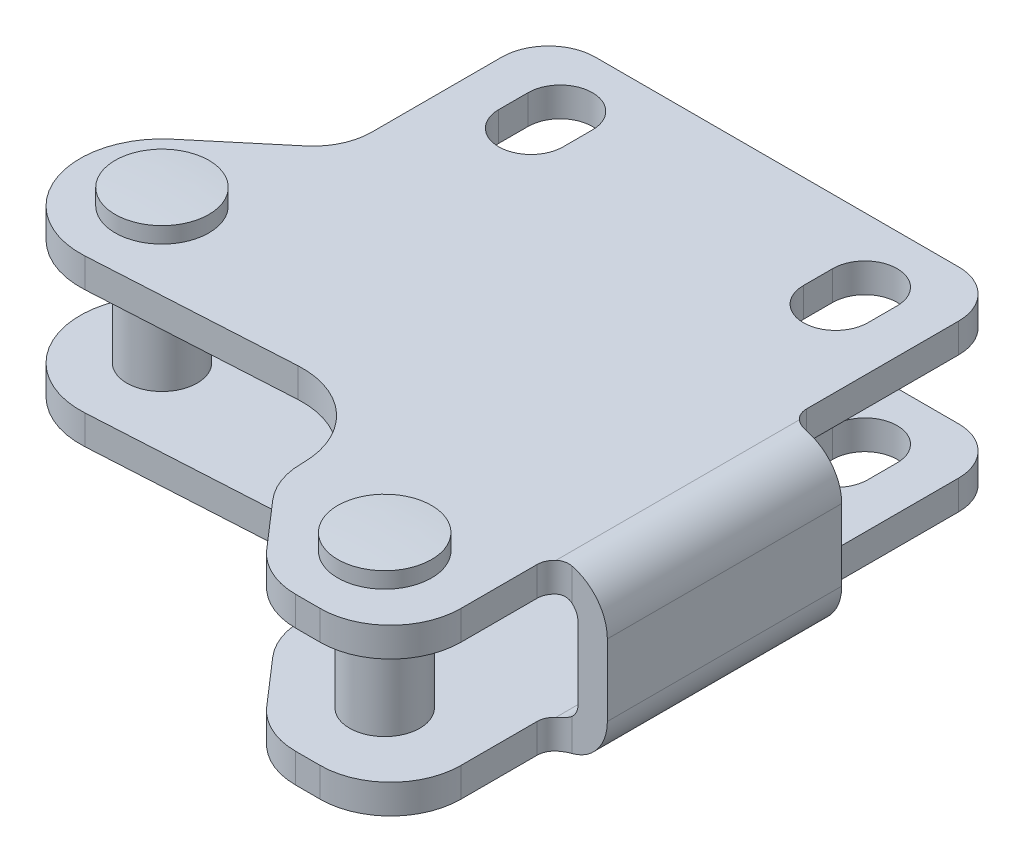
ISO-10303-21;
HEADER;
FILE_DESCRIPTION(('STEP AP214'),'2;1');
FILE_NAME('part.step','',(''),(''),'','','');
FILE_SCHEMA(('AUTOMOTIVE_DESIGN { 1 0 10303 214 1 1 1 1 }'));
ENDSEC;
DATA;
#1=APPLICATION_CONTEXT('core data for automotive mechanical design processes');
#2=APPLICATION_PROTOCOL_DEFINITION('international standard','automotive_design',2000,#1);
#3=PRODUCT_CONTEXT('',#1,'mechanical');
#4=PRODUCT('Part','Part','',(#3));
#5=PRODUCT_RELATED_PRODUCT_CATEGORY('part','',(#4));
#6=PRODUCT_DEFINITION_FORMATION('','',#4);
#7=PRODUCT_DEFINITION_CONTEXT('part definition',#1,'design');
#8=PRODUCT_DEFINITION('design','',#6,#7);
#9=PRODUCT_DEFINITION_SHAPE('','',#8);
#10=(LENGTH_UNIT() NAMED_UNIT(*) SI_UNIT(.MILLI.,.METRE.));
#11=(NAMED_UNIT(*) PLANE_ANGLE_UNIT() SI_UNIT($,.RADIAN.));
#12=(NAMED_UNIT(*) SI_UNIT($,.STERADIAN.) SOLID_ANGLE_UNIT());
#13=UNCERTAINTY_MEASURE_WITH_UNIT(LENGTH_MEASURE(1.E-05),#10,'distance_accuracy_value','');
#14=(GEOMETRIC_REPRESENTATION_CONTEXT(3) GLOBAL_UNCERTAINTY_ASSIGNED_CONTEXT((#13)) GLOBAL_UNIT_ASSIGNED_CONTEXT((#10,
#11,#12)) REPRESENTATION_CONTEXT('',''));
#15=CARTESIAN_POINT('',(0.,0.,0.));
#16=DIRECTION('',(0.,0.,1.));
#17=DIRECTION('',(1.,0.,0.));
#18=AXIS2_PLACEMENT_3D('',#15,#16,#17);
#19=CARTESIAN_POINT('',(-10.,-5.3952994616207,23.98));
#20=DIRECTION('',(0.,1.,0.));
#21=DIRECTION('',(1.,0.,0.));
#22=AXIS2_PLACEMENT_3D('',#19,#20,#21);
#23=CYLINDRICAL_SURFACE('',#22,3.);
#24=CARTESIAN_POINT('',(-10.,-4.55,23.98));
#25=DIRECTION('',(0.,1.,0.));
#26=DIRECTION('',(-1.,0.,0.));
#27=AXIS2_PLACEMENT_3D('',#24,#25,#26);
#28=CIRCLE('',#27,3.);
#29=CARTESIAN_POINT('',(-13.,-4.55,23.98));
#30=VERTEX_POINT('',#29);
#31=EDGE_CURVE('E9',#30,#30,#28,.F.);
#32=ORIENTED_EDGE('',*,*,#31,.F.);
#33=EDGE_LOOP('',(#32));
#34=FACE_BOUND('',#33,.T.);
#35=CARTESIAN_POINT('',(-10.,4.55,23.98));
#36=DIRECTION('',(0.,-1.,0.));
#37=DIRECTION('',(1.,0.,0.));
#38=AXIS2_PLACEMENT_3D('',#35,#36,#37);
#39=CIRCLE('',#38,3.);
#40=CARTESIAN_POINT('',(-7.,4.55,23.98));
#41=VERTEX_POINT('',#40);
#42=EDGE_CURVE('E24',#41,#41,#39,.F.);
#43=ORIENTED_EDGE('',*,*,#42,.F.);
#44=EDGE_LOOP('',(#43));
#45=FACE_BOUND('',#44,.T.);
#46=ADVANCED_FACE('F14',(#34,#45),#23,.T.);
#47=CARTESIAN_POINT('',(-10.,-6.55,23.98));
#48=DIRECTION('',(0.,-1.,0.));
#49=DIRECTION('',(-1.,0.,0.));
#50=AXIS2_PLACEMENT_3D('',#47,#48,#49);
#51=CONICAL_SURFACE('',#50,2.,1.04719755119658);
#52=CARTESIAN_POINT('',(-10.,-5.3952994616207,23.98));
#53=VERTEX_POINT('',#52);
#54=VERTEX_LOOP('',#53);
#55=FACE_BOUND('',#54,.T.);
#56=CARTESIAN_POINT('',(-10.,-6.55,23.98));
#57=DIRECTION('',(0.,1.,0.));
#58=DIRECTION('',(1.,0.,0.));
#59=AXIS2_PLACEMENT_3D('',#56,#57,#58);
#60=CIRCLE('',#59,2.);
#61=CARTESIAN_POINT('',(-8.,-6.55,23.98));
#62=VERTEX_POINT('',#61);
#63=EDGE_CURVE('E924',#62,#62,#60,.T.);
#64=ORIENTED_EDGE('',*,*,#63,.F.);
#65=EDGE_LOOP('',(#64));
#66=FACE_BOUND('',#65,.T.);
#67=ADVANCED_FACE('F724',(#55,#66),#51,.F.);
#68=CARTESIAN_POINT('',(-10.,-5.3952994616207,23.98));
#69=DIRECTION('',(0.,1.,0.));
#70=DIRECTION('',(1.,0.,0.));
#71=AXIS2_PLACEMENT_3D('',#68,#69,#70);
#72=CYLINDRICAL_SURFACE('',#71,2.);
#73=ORIENTED_EDGE('',*,*,#63,.T.);
#74=EDGE_LOOP('',(#73));
#75=FACE_BOUND('',#74,.T.);
#76=CARTESIAN_POINT('',(-10.,-8.5166574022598,23.98));
#77=DIRECTION('',(0.,1.,0.));
#78=DIRECTION('',(1.,0.,0.));
#79=AXIS2_PLACEMENT_3D('',#76,#77,#78);
#80=CIRCLE('',#79,2.);
#81=CARTESIAN_POINT('',(-10.,-8.51665740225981,21.9800000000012));
#82=VERTEX_POINT('',#81);
#83=EDGE_CURVE('E1010',#82,#82,#80,.T.);
#84=ORIENTED_EDGE('',*,*,#83,.F.);
#85=EDGE_LOOP('',(#84));
#86=FACE_BOUND('',#85,.T.);
#87=ADVANCED_FACE('F732',(#75,#86),#72,.F.);
#88=CARTESIAN_POINT('',(-10.,51.4500000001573,23.9800000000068));
#89=DIRECTION('',(0.,1.,0.));
#90=DIRECTION('',(0.,0.,-1.));
#91=AXIS2_PLACEMENT_3D('',#88,#89,#90);
#92=SPHERICAL_SURFACE('',#91,60.0000000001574);
#93=CARTESIAN_POINT('',(-10.,-8.4165181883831,23.98));
#94=DIRECTION('',(0.,1.,0.));
#95=DIRECTION('',(1.,0.,0.));
#96=AXIS2_PLACEMENT_3D('',#93,#94,#95);
#97=CIRCLE('',#96,4.);
#98=CARTESIAN_POINT('',(-10.,-8.41651818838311,19.9800000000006));
#99=VERTEX_POINT('',#98);
#100=EDGE_CURVE('E1007',#99,#99,#97,.T.);
#101=CARTESIAN_POINT('',(-10.,-8.51665740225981,21.9800000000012));
#102=CARTESIAN_POINT('',(-10.,-8.51596205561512,21.9591511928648));
#103=CARTESIAN_POINT('',(-10.,-8.51525583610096,21.9383027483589));
#104=CARTESIAN_POINT('',(-10.,-8.51382165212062,21.8966066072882));
#105=CARTESIAN_POINT('',(-10.,-8.51309368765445,21.8757589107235));
#106=CARTESIAN_POINT('',(-10.,-8.51161601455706,21.8340642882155));
#107=CARTESIAN_POINT('',(-10.,-8.51086630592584,21.8132173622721));
#108=CARTESIAN_POINT('',(-10.,-8.50934514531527,21.771524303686));
#109=CARTESIAN_POINT('',(-10.,-8.50857369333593,21.7506781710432));
#110=CARTESIAN_POINT('',(-10.,-8.50700904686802,21.7089867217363));
#111=CARTESIAN_POINT('',(-10.,-8.50621585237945,21.6881414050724));
#112=CARTESIAN_POINT('',(-10.,-8.50460772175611,21.6464516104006));
#113=CARTESIAN_POINT('',(-10.,-8.50379278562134,21.6256071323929));
#114=CARTESIAN_POINT('',(-10.,-8.5021411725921,21.5839190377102));
#115=CARTESIAN_POINT('',(-10.,-8.50130449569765,21.5630754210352));
#116=CARTESIAN_POINT('',(-10.,-8.49960940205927,21.5213890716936));
#117=CARTESIAN_POINT('',(-10.,-8.49875098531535,21.500546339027));
#118=CARTESIAN_POINT('',(-10.,-8.49701241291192,21.4588617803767));
#119=CARTESIAN_POINT('',(-10.,-8.4961322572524,21.438019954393));
#120=CARTESIAN_POINT('',(-10.,-8.49435020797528,21.3963372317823));
#121=CARTESIAN_POINT('',(-10.,-8.49344831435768,21.3754963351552));
#122=CARTESIAN_POINT('',(-10.,-8.49162279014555,21.3338154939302));
#123=CARTESIAN_POINT('',(-10.,-8.49069915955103,21.3129755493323));
#124=CARTESIAN_POINT('',(-10.,-8.48883016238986,21.2712966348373));
#125=CARTESIAN_POINT('',(-10.,-8.48788479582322,21.2504576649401));
#126=CARTESIAN_POINT('',(-10.,-8.48597232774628,21.2087807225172));
#127=CARTESIAN_POINT('',(-10.,-8.48500522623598,21.1879427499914));
#128=CARTESIAN_POINT('',(-10.,-8.48304928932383,21.1462678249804));
#129=CARTESIAN_POINT('',(-10.,-8.48206045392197,21.1254308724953));
#130=CARTESIAN_POINT('',(-10.,-8.48006105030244,21.0837580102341));
#131=CARTESIAN_POINT('',(-10.,-8.47905048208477,21.0629221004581));
#132=CARTESIAN_POINT('',(-10.,-8.477007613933,21.0212513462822));
#133=CARTESIAN_POINT('',(-10.,-8.47597531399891,21.0004165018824));
#134=CARTESIAN_POINT('',(-10.,-8.47388898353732,20.958747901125));
#135=CARTESIAN_POINT('',(-10.,-8.47283495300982,20.9379141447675));
#136=CARTESIAN_POINT('',(-10.,-8.4707051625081,20.8962477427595));
#137=CARTESIAN_POINT('',(-10.,-8.46962940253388,20.8754150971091));
#138=CARTESIAN_POINT('',(-10.,-8.46745615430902,20.8337509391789));
#139=CARTESIAN_POINT('',(-10.,-8.46635866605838,20.8129194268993));
#140=CARTESIAN_POINT('',(-10.,-8.46414196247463,20.7712575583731));
#141=CARTESIAN_POINT('',(-10.,-8.46302274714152,20.7504272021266));
#142=CARTESIAN_POINT('',(-10.,-8.46076259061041,20.7087676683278));
#143=CARTESIAN_POINT('',(-10.,-8.45962164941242,20.6879384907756));
#144=CARTESIAN_POINT('',(-10.,-8.45731804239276,20.6462813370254));
#145=CARTESIAN_POINT('',(-10.,-8.4561553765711,20.6254533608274));
#146=CARTESIAN_POINT('',(-10.,-8.45380832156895,20.583798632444));
#147=CARTESIAN_POINT('',(-10.,-8.45262393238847,20.5629718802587));
#148=CARTESIAN_POINT('',(-10.,-8.45023343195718,20.5213196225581));
#149=CARTESIAN_POINT('',(-10.,-8.44902732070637,20.5004941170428));
#150=CARTESIAN_POINT('',(-10.,-8.44659337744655,20.4588443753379));
#151=CARTESIAN_POINT('',(-10.,-8.44536554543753,20.4380201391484));
#152=CARTESIAN_POINT('',(-10.,-8.44288816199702,20.3963729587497));
#153=CARTESIAN_POINT('',(-10.,-8.44163861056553,20.3755500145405));
#154=CARTESIAN_POINT('',(-10.,-8.43911778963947,20.3339054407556));
#155=CARTESIAN_POINT('',(-10.,-8.4378465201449,20.3130838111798));
#156=CARTESIAN_POINT('',(-10.,-8.43528226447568,20.2714418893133));
#157=CARTESIAN_POINT('',(-10.,-8.43398927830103,20.2506215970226));
#158=CARTESIAN_POINT('',(-10.,-8.4313815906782,20.2089823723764));
#159=CARTESIAN_POINT('',(-10.,-8.43006688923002,20.188163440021));
#160=CARTESIAN_POINT('',(-10.,-8.42741577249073,20.1465269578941));
#161=CARTESIAN_POINT('',(-10.,-8.42607935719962,20.1257094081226));
#162=CARTESIAN_POINT('',(-10.,-8.42338481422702,20.0840757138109));
#163=CARTESIAN_POINT('',(-10.,-8.42202668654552,20.0632595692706));
#164=CARTESIAN_POINT('',(-10.,-8.41928872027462,20.0216287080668));
#165=CARTESIAN_POINT('',(-10.,-8.41790888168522,20.0008139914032));
#166=CARTESIAN_POINT('',(-10.,-8.41651818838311,19.9800000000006));
#167=B_SPLINE_CURVE_WITH_KNOTS('',3,(#101,#102,#103,#104,#105,#106,#107,#108,#109,#110,#111,
#112,#113,#114,#115,#116,#117,#118,#119,#120,#121,#122,#123,#124,#125,#126,#127,#128,#129,#130,
#131,#132,#133,#134,#135,#136,#137,#138,#139,#140,#141,#142,#143,#144,#145,#146,#147,#148,#149,
#150,#151,#152,#153,#154,#155,#156,#157,#158,#159,#160,#161,#162,#163,#164,#165,#166),
.UNSPECIFIED.,.F.,.F.,(4,2,2,2,2,2,2,2,2,2,2,2,2,2,2,2,2,2,2,2,2,2,2,2,2,2,2,2,2,2,2,2,4),(0.,
0.0625811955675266,0.125162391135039,0.187743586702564,0.250324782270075,0.312905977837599,
0.375487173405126,0.438068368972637,0.500649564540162,0.563230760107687,0.625811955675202,
0.688393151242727,0.750974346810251,0.813555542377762,0.876136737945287,0.938717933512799,
1.00129912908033,1.06388032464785,1.12646152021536,1.18904271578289,1.2516239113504,
1.31420510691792,1.37678630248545,1.43936749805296,1.50194869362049,1.56452988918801,
1.62711108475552,1.68969228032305,1.75227347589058,1.81485467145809,1.87743586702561,
1.94001706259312,2.00259825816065),.UNSPECIFIED.);
#168=EDGE_CURVE('BSEAM728',#82,#99,#167,.T.);
#169=ORIENTED_EDGE('',*,*,#83,.T.);
#170=ORIENTED_EDGE('',*,*,#100,.F.);
#171=ORIENTED_EDGE('',*,*,#168,.T.);
#172=ORIENTED_EDGE('',*,*,#168,.F.);
#173=EDGE_LOOP('',(#169,#171,#170,#172));
#174=FACE_BOUND('',#173,.T.);
#175=ADVANCED_FACE('F728',(#174),#92,.T.);
#176=CARTESIAN_POINT('',(-10.,-5.3952994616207,23.98));
#177=DIRECTION('',(0.,1.,0.));
#178=DIRECTION('',(1.,0.,0.));
#179=AXIS2_PLACEMENT_3D('',#176,#177,#178);
#180=CYLINDRICAL_SURFACE('',#179,4.);
#181=ORIENTED_EDGE('',*,*,#100,.T.);
#182=EDGE_LOOP('',(#181));
#183=FACE_BOUND('',#182,.T.);
#184=CARTESIAN_POINT('',(-10.,-7.05,23.98));
#185=DIRECTION('',(0.,1.,0.));
#186=DIRECTION('',(1.,0.,0.));
#187=AXIS2_PLACEMENT_3D('',#184,#185,#186);
#188=CIRCLE('',#187,4.);
#189=CARTESIAN_POINT('',(-6.,-7.05,23.98));
#190=VERTEX_POINT('',#189);
#191=EDGE_CURVE('E1004',#190,#190,#188,.T.);
#192=ORIENTED_EDGE('',*,*,#191,.F.);
#193=EDGE_LOOP('',(#192));
#194=FACE_BOUND('',#193,.T.);
#195=ADVANCED_FACE('F717',(#183,#194),#180,.T.);
#196=CARTESIAN_POINT('',(-10.,-51.4500000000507,23.9800000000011));
#197=DIRECTION('',(0.,1.,0.));
#198=DIRECTION('',(0.,0.,-1.));
#199=AXIS2_PLACEMENT_3D('',#196,#197,#198);
#200=SPHERICAL_SURFACE('',#199,60.0000000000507);
#201=CARTESIAN_POINT('',(-10.,8.41651818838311,23.98));
#202=DIRECTION('',(0.,1.,0.));
#203=DIRECTION('',(1.,0.,0.));
#204=AXIS2_PLACEMENT_3D('',#201,#202,#203);
#205=CIRCLE('',#204,3.99999999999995);
#206=CARTESIAN_POINT('',(-6.00000000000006,8.41651818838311,23.98));
#207=VERTEX_POINT('',#206);
#208=EDGE_CURVE('E997',#207,#207,#205,.T.);
#209=ORIENTED_EDGE('',*,*,#208,.T.);
#210=EDGE_LOOP('',(#209));
#211=FACE_BOUND('',#210,.T.);
#212=ADVANCED_FACE('F714',(#211),#200,.T.);
#213=CARTESIAN_POINT('',(-10.,-5.3952994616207,23.98));
#214=DIRECTION('',(0.,1.,0.));
#215=DIRECTION('',(1.,0.,0.));
#216=AXIS2_PLACEMENT_3D('',#213,#214,#215);
#217=CYLINDRICAL_SURFACE('',#216,4.);
#218=CARTESIAN_POINT('',(-10.,7.05,23.98));
#219=DIRECTION('',(0.,1.,0.));
#220=DIRECTION('',(1.,0.,0.));
#221=AXIS2_PLACEMENT_3D('',#218,#219,#220);
#222=CIRCLE('',#221,4.);
#223=CARTESIAN_POINT('',(-6.,7.05,23.98));
#224=VERTEX_POINT('',#223);
#225=EDGE_CURVE('E999',#224,#224,#222,.T.);
#226=ORIENTED_EDGE('',*,*,#225,.T.);
#227=EDGE_LOOP('',(#226));
#228=FACE_BOUND('',#227,.T.);
#229=ORIENTED_EDGE('',*,*,#208,.F.);
#230=EDGE_LOOP('',(#229));
#231=FACE_BOUND('',#230,.T.);
#232=ADVANCED_FACE('F712',(#228,#231),#217,.T.);
#233=CARTESIAN_POINT('',(25.,-6.55,39.98));
#234=DIRECTION('',(0.,-1.,0.));
#235=DIRECTION('',(-0.99958536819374,0.,-0.028793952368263));
#236=AXIS2_PLACEMENT_3D('',#233,#234,#235);
#237=CONICAL_SURFACE('',#236,2.,1.04719755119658);
#238=CARTESIAN_POINT('',(25.,-5.3952994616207,39.98));
#239=VERTEX_POINT('',#238);
#240=VERTEX_LOOP('',#239);
#241=FACE_BOUND('',#240,.T.);
#242=CARTESIAN_POINT('',(25.,-6.55,39.98));
#243=DIRECTION('',(0.,1.,0.));
#244=DIRECTION('',(0.99958536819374,0.,0.028793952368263));
#245=AXIS2_PLACEMENT_3D('',#242,#243,#244);
#246=CIRCLE('',#245,2.);
#247=CARTESIAN_POINT('',(26.9991707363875,-6.55,40.0375879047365));
#248=VERTEX_POINT('',#247);
#249=EDGE_CURVE('E964',#248,#248,#246,.T.);
#250=ORIENTED_EDGE('',*,*,#249,.F.);
#251=EDGE_LOOP('',(#250));
#252=FACE_BOUND('',#251,.T.);
#253=ADVANCED_FACE('F632',(#241,#252),#237,.F.);
#254=CARTESIAN_POINT('',(25.,-5.3952994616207,39.98));
#255=DIRECTION('',(0.,1.,0.));
#256=DIRECTION('',(0.99958536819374,0.,0.028793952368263));
#257=AXIS2_PLACEMENT_3D('',#254,#255,#256);
#258=CYLINDRICAL_SURFACE('',#257,2.);
#259=ORIENTED_EDGE('',*,*,#249,.T.);
#260=EDGE_LOOP('',(#259));
#261=FACE_BOUND('',#260,.T.);
#262=CARTESIAN_POINT('',(25.,-8.5166574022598,39.98));
#263=DIRECTION('',(0.,1.,0.));
#264=DIRECTION('',(0.99958536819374,0.,0.028793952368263));
#265=AXIS2_PLACEMENT_3D('',#262,#263,#264);
#266=CIRCLE('',#265,2.);
#267=CARTESIAN_POINT('',(25.0575879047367,-8.51665740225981,37.9808292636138));
#268=VERTEX_POINT('',#267);
#269=EDGE_CURVE('E966',#268,#268,#266,.T.);
#270=ORIENTED_EDGE('',*,*,#269,.F.);
#271=EDGE_LOOP('',(#270));
#272=FACE_BOUND('',#271,.T.);
#273=ADVANCED_FACE('F665',(#261,#272),#258,.F.);
#274=CARTESIAN_POINT('',(25.,-51.4500000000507,39.9800000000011));
#275=DIRECTION('',(0.,1.,0.));
#276=DIRECTION('',(0.028793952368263,0.,-0.99958536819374));
#277=AXIS2_PLACEMENT_3D('',#274,#275,#276);
#278=SPHERICAL_SURFACE('',#277,60.0000000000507);
#279=CARTESIAN_POINT('',(25.,8.41651818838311,39.98));
#280=DIRECTION('',(0.,1.,0.));
#281=DIRECTION('',(0.99958536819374,0.,0.028793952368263));
#282=AXIS2_PLACEMENT_3D('',#279,#280,#281);
#283=CIRCLE('',#282,3.99999999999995);
#284=CARTESIAN_POINT('',(28.9983414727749,8.41651818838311,40.0951758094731));
#285=VERTEX_POINT('',#284);
#286=EDGE_CURVE('E928',#285,#285,#283,.T.);
#287=ORIENTED_EDGE('',*,*,#286,.T.);
#288=EDGE_LOOP('',(#287));
#289=FACE_BOUND('',#288,.T.);
#290=ADVANCED_FACE('F625',(#289),#278,.T.);
#291=CARTESIAN_POINT('',(34.5,-3.05,56.98));
#292=DIRECTION('',(-1.,0.,0.));
#293=DIRECTION('',(0.,-1.,0.));
#294=AXIS2_PLACEMENT_3D('',#291,#292,#293);
#295=PLANE('',#294);
#296=DIRECTION('',(0.,0.,-1.));
#297=VECTOR('',#296,1.);
#298=CARTESIAN_POINT('',(34.5,-3.05,56.98));
#299=LINE('',#298,#297);
#300=CARTESIAN_POINT('',(34.5,-3.05,32.98));
#301=VERTEX_POINT('',#300);
#302=CARTESIAN_POINT('',(34.5,-3.05,12.98));
#303=VERTEX_POINT('',#302);
#304=EDGE_CURVE('E1273',#301,#303,#299,.T.);
#305=ORIENTED_EDGE('',*,*,#304,.F.);
#306=DIRECTION('',(0.,-1.,0.));
#307=VECTOR('',#306,1.);
#308=CARTESIAN_POINT('',(34.5,-7.05,32.98));
#309=LINE('',#308,#307);
#310=CARTESIAN_POINT('',(34.5,3.05,32.98));
#311=VERTEX_POINT('',#310);
#312=EDGE_CURVE('E908',#311,#301,#309,.T.);
#313=ORIENTED_EDGE('',*,*,#312,.F.);
#314=DIRECTION('',(0.,0.,-1.));
#315=VECTOR('',#314,1.);
#316=CARTESIAN_POINT('',(34.5,3.05,56.98));
#317=LINE('',#316,#315);
#318=CARTESIAN_POINT('',(34.5,3.05,12.98));
#319=VERTEX_POINT('',#318);
#320=EDGE_CURVE('E1279',#311,#319,#317,.T.);
#321=ORIENTED_EDGE('',*,*,#320,.T.);
#322=DIRECTION('',(0.,1.,0.));
#323=VECTOR('',#322,1.);
#324=CARTESIAN_POINT('',(34.5,-7.05,12.98));
#325=LINE('',#324,#323);
#326=EDGE_CURVE('E1241',#303,#319,#325,.T.);
#327=ORIENTED_EDGE('',*,*,#326,.F.);
#328=EDGE_LOOP('',(#305,#313,#321,#327));
#329=FACE_BOUND('',#328,.T.);
#330=ADVANCED_FACE('F620',(#329),#295,.T.);
#331=CARTESIAN_POINT('',(37.,-7.05,12.98));
#332=DIRECTION('',(0.,0.,-1.));
#333=DIRECTION('',(0.,-1.,0.));
#334=AXIS2_PLACEMENT_3D('',#331,#332,#333);
#335=PLANE('',#334);
#336=DIRECTION('',(0.,1.,0.));
#337=VECTOR('',#336,1.);
#338=CARTESIAN_POINT('',(34.,-7.05,12.98));
#339=LINE('',#338,#337);
#340=CARTESIAN_POINT('',(34.,4.16803398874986,12.98));
#341=VERTEX_POINT('',#340);
#342=CARTESIAN_POINT('',(34.,6.92298334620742,12.98));
#343=VERTEX_POINT('',#342);
#344=EDGE_CURVE('E901',#341,#343,#339,.T.);
#345=ORIENTED_EDGE('',*,*,#344,.T.);
#346=CARTESIAN_POINT('',(33.,3.05,12.98));
#347=DIRECTION('',(0.,0.,-1.));
#348=DIRECTION('',(0.,-1.,0.));
#349=AXIS2_PLACEMENT_3D('',#346,#347,#348);
#350=CIRCLE('',#349,4.);
#351=CARTESIAN_POINT('',(37.,3.05,12.98));
#352=VERTEX_POINT('',#351);
#353=EDGE_CURVE('E816',#343,#352,#350,.T.);
#354=ORIENTED_EDGE('',*,*,#353,.T.);
#355=DIRECTION('',(0.,1.,0.));
#356=VECTOR('',#355,1.);
#357=CARTESIAN_POINT('',(37.,-7.05,12.98));
#358=LINE('',#357,#356);
#359=CARTESIAN_POINT('',(37.,-3.05,12.98));
#360=VERTEX_POINT('',#359);
#361=EDGE_CURVE('E904',#360,#352,#358,.T.);
#362=ORIENTED_EDGE('',*,*,#361,.F.);
#363=CARTESIAN_POINT('',(33.,-3.05,12.98));
#364=DIRECTION('',(0.,0.,-1.));
#365=DIRECTION('',(0.,-1.,0.));
#366=AXIS2_PLACEMENT_3D('',#363,#364,#365);
#367=CIRCLE('',#366,4.);
#368=CARTESIAN_POINT('',(34.,-6.92298334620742,12.98));
#369=VERTEX_POINT('',#368);
#370=EDGE_CURVE('E807',#360,#369,#367,.T.);
#371=ORIENTED_EDGE('',*,*,#370,.T.);
#372=CARTESIAN_POINT('',(34.,-4.16803398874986,12.98));
#373=VERTEX_POINT('',#372);
#374=EDGE_CURVE('E902',#369,#373,#339,.T.);
#375=ORIENTED_EDGE('',*,*,#374,.T.);
#376=CARTESIAN_POINT('',(33.,-3.05,12.98));
#377=DIRECTION('',(0.,0.,-1.));
#378=DIRECTION('',(0.,-1.,0.));
#379=AXIS2_PLACEMENT_3D('',#376,#377,#378);
#380=CIRCLE('',#379,1.50000000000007);
#381=EDGE_CURVE('E583',#373,#303,#380,.F.);
#382=ORIENTED_EDGE('',*,*,#381,.T.);
#383=ORIENTED_EDGE('',*,*,#326,.T.);
#384=CARTESIAN_POINT('',(33.,3.04999999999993,12.98));
#385=DIRECTION('',(0.,0.,-1.));
#386=DIRECTION('',(0.,-1.,0.));
#387=AXIS2_PLACEMENT_3D('',#384,#385,#386);
#388=CIRCLE('',#387,1.50000000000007);
#389=EDGE_CURVE('E607',#319,#341,#388,.F.);
#390=ORIENTED_EDGE('',*,*,#389,.T.);
#391=EDGE_LOOP('',(#345,#354,#362,#371,#375,#382,#383,#390));
#392=FACE_BOUND('',#391,.T.);
#393=ADVANCED_FACE('F592',(#392),#335,.T.);
#394=CARTESIAN_POINT('',(34.,-7.05,32.98));
#395=DIRECTION('',(0.,0.,1.));
#396=DIRECTION('',(0.,1.,0.));
#397=AXIS2_PLACEMENT_3D('',#394,#395,#396);
#398=PLANE('',#397);
#399=DIRECTION('',(0.,1.,0.));
#400=VECTOR('',#399,1.);
#401=CARTESIAN_POINT('',(37.,-7.05,32.98));
#402=LINE('',#401,#400);
#403=CARTESIAN_POINT('',(37.,-3.05,32.98));
#404=VERTEX_POINT('',#403);
#405=CARTESIAN_POINT('',(37.,3.05,32.98));
#406=VERTEX_POINT('',#405);
#407=EDGE_CURVE('E812',#404,#406,#402,.T.);
#408=ORIENTED_EDGE('',*,*,#407,.T.);
#409=CARTESIAN_POINT('',(33.,3.05,32.98));
#410=DIRECTION('',(0.,0.,1.));
#411=DIRECTION('',(0.,1.,0.));
#412=AXIS2_PLACEMENT_3D('',#409,#410,#411);
#413=CIRCLE('',#412,4.);
#414=CARTESIAN_POINT('',(34.,6.92298334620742,32.98));
#415=VERTEX_POINT('',#414);
#416=EDGE_CURVE('E526',#406,#415,#413,.T.);
#417=ORIENTED_EDGE('',*,*,#416,.T.);
#418=DIRECTION('',(0.,1.,0.));
#419=VECTOR('',#418,1.);
#420=CARTESIAN_POINT('',(34.,-7.05,32.98));
#421=LINE('',#420,#419);
#422=CARTESIAN_POINT('',(34.,4.16803398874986,32.98));
#423=VERTEX_POINT('',#422);
#424=EDGE_CURVE('E819',#423,#415,#421,.T.);
#425=ORIENTED_EDGE('',*,*,#424,.F.);
#426=CARTESIAN_POINT('',(33.,3.04999999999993,32.98));
#427=DIRECTION('',(0.,0.,1.));
#428=DIRECTION('',(0.,1.,0.));
#429=AXIS2_PLACEMENT_3D('',#426,#427,#428);
#430=CIRCLE('',#429,1.50000000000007);
#431=EDGE_CURVE('E911',#423,#311,#430,.F.);
#432=ORIENTED_EDGE('',*,*,#431,.T.);
#433=ORIENTED_EDGE('',*,*,#312,.T.);
#434=CARTESIAN_POINT('',(33.,-3.05,32.98));
#435=DIRECTION('',(0.,0.,1.));
#436=DIRECTION('',(0.,1.,0.));
#437=AXIS2_PLACEMENT_3D('',#434,#435,#436);
#438=CIRCLE('',#437,1.50000000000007);
#439=CARTESIAN_POINT('',(34.,-4.16803398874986,32.98));
#440=VERTEX_POINT('',#439);
#441=EDGE_CURVE('E906',#301,#440,#438,.F.);
#442=ORIENTED_EDGE('',*,*,#441,.T.);
#443=CARTESIAN_POINT('',(34.,-6.92298334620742,32.98));
#444=VERTEX_POINT('',#443);
#445=EDGE_CURVE('E814',#444,#440,#421,.T.);
#446=ORIENTED_EDGE('',*,*,#445,.F.);
#447=CARTESIAN_POINT('',(33.,-3.05,32.98));
#448=DIRECTION('',(0.,0.,1.));
#449=DIRECTION('',(0.,1.,0.));
#450=AXIS2_PLACEMENT_3D('',#447,#448,#449);
#451=CIRCLE('',#450,4.);
#452=EDGE_CURVE('E804',#444,#404,#451,.T.);
#453=ORIENTED_EDGE('',*,*,#452,.T.);
#454=EDGE_LOOP('',(#408,#417,#425,#432,#433,#442,#446,#453));
#455=FACE_BOUND('',#454,.T.);
#456=ADVANCED_FACE('F637',(#455),#398,.T.);
#457=CARTESIAN_POINT('',(37.,-7.05,32.98));
#458=DIRECTION('',(1.,0.,0.));
#459=DIRECTION('',(0.,1.,0.));
#460=AXIS2_PLACEMENT_3D('',#457,#458,#459);
#461=PLANE('',#460);
#462=DIRECTION('',(0.,0.,-1.));
#463=VECTOR('',#462,1.);
#464=CARTESIAN_POINT('',(37.,3.05,56.98));
#465=LINE('',#464,#463);
#466=EDGE_CURVE('E521',#406,#352,#465,.T.);
#467=ORIENTED_EDGE('',*,*,#466,.F.);
#468=ORIENTED_EDGE('',*,*,#407,.F.);
#469=DIRECTION('',(0.,0.,-1.));
#470=VECTOR('',#469,1.);
#471=CARTESIAN_POINT('',(37.,-3.05,56.98));
#472=LINE('',#471,#470);
#473=EDGE_CURVE('E518',#404,#360,#472,.T.);
#474=ORIENTED_EDGE('',*,*,#473,.T.);
#475=ORIENTED_EDGE('',*,*,#361,.T.);
#476=EDGE_LOOP('',(#467,#468,#474,#475));
#477=FACE_BOUND('',#476,.T.);
#478=ADVANCED_FACE('F16',(#477),#461,.T.);
#479=CARTESIAN_POINT('',(25.,51.4500000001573,39.9800000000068));
#480=DIRECTION('',(0.,1.,0.));
#481=DIRECTION('',(0.028793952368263,0.,-0.99958536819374));
#482=AXIS2_PLACEMENT_3D('',#479,#480,#481);
#483=SPHERICAL_SURFACE('',#482,60.0000000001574);
#484=CARTESIAN_POINT('',(25.,-8.4165181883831,39.98));
#485=DIRECTION('',(0.,1.,0.));
#486=DIRECTION('',(0.99958536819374,0.,0.028793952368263));
#487=AXIS2_PLACEMENT_3D('',#484,#485,#486);
#488=CIRCLE('',#487,4.);
#489=CARTESIAN_POINT('',(25.1151758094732,-8.41651818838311,35.9816585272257));
#490=VERTEX_POINT('',#489);
#491=EDGE_CURVE('E969',#490,#490,#488,.T.);
#492=CARTESIAN_POINT('',(25.0575879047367,-8.51665740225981,37.9808292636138));
#493=CARTESIAN_POINT('',(25.0581882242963,-8.51596205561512,37.9599891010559));
#494=CARTESIAN_POINT('',(25.0587885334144,-8.51525583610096,37.9391493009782));
#495=CARTESIAN_POINT('',(25.0599891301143,-8.51382165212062,37.8974704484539));
#496=CARTESIAN_POINT('',(25.0605894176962,-8.51309368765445,37.8766313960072));
#497=CARTESIAN_POINT('',(25.0617899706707,-8.51161601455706,37.8349540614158));
#498=CARTESIAN_POINT('',(25.0623902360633,-8.51086630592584,37.814115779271));
#499=CARTESIAN_POINT('',(25.0635907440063,-8.50934514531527,37.7724400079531));
#500=CARTESIAN_POINT('',(25.0641909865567,-8.50857369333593,37.7516025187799));
#501=CARTESIAN_POINT('',(25.0653914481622,-8.50700904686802,37.709928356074));
#502=CARTESIAN_POINT('',(25.0659916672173,-8.50621585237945,37.6890916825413));
#503=CARTESIAN_POINT('',(25.0671920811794,-8.50460772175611,37.6474191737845));
#504=CARTESIAN_POINT('',(25.0677922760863,-8.50379278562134,37.6265833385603));
#505=CARTESIAN_POINT('',(25.0689926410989,-8.5021411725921,37.5849125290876));
#506=CARTESIAN_POINT('',(25.0695928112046,-8.50130449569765,37.5640775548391));
#507=CARTESIAN_POINT('',(25.0707931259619,-8.49960940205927,37.5224084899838));
#508=CARTESIAN_POINT('',(25.0713932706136,-8.49875098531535,37.5015743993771));
#509=CARTESIAN_POINT('',(25.0725935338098,-8.49701241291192,37.4599071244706));
#510=CARTESIAN_POINT('',(25.0731936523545,-8.4961322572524,37.4390739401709));
#511=CARTESIAN_POINT('',(25.0743938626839,-8.49435020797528,37.3974085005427));
#512=CARTESIAN_POINT('',(25.0749939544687,-8.49344831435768,37.3765762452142));
#513=CARTESIAN_POINT('',(25.0761941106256,-8.49162279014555,37.3349126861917));
#514=CARTESIAN_POINT('',(25.0767941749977,-8.49069915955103,37.3140813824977));
#515=CARTESIAN_POINT('',(25.0779942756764,-8.48883016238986,37.2724197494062));
#516=CARTESIAN_POINT('',(25.0785943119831,-8.48788479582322,37.2515894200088));
#517=CARTESIAN_POINT('',(25.079794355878,-8.48597232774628,37.2099297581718));
#518=CARTESIAN_POINT('',(25.0803943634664,-8.48500522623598,37.1891004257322));
#519=CARTESIAN_POINT('',(25.0815943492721,-8.48304928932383,37.1474427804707));
#520=CARTESIAN_POINT('',(25.0821943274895,-8.48206045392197,37.1266144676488));
#521=CARTESIAN_POINT('',(25.0833942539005,-8.48006105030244,37.0849588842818));
#522=CARTESIAN_POINT('',(25.0839942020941,-8.47905048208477,37.0641316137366));
#523=CARTESIAN_POINT('',(25.085194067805,-8.477007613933,37.0224781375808));
#524=CARTESIAN_POINT('',(25.0857939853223,-8.47597531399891,37.0016519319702));
#525=CARTESIAN_POINT('',(25.0869937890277,-8.47388898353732,36.96000060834));
#526=CARTESIAN_POINT('',(25.0875936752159,-8.47283495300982,36.9391754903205));
#527=CARTESIAN_POINT('',(25.0887934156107,-8.4707051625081,36.897526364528));
#528=CARTESIAN_POINT('',(25.0893932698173,-8.46962940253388,36.8767023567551));
#529=CARTESIAN_POINT('',(25.0905929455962,-8.46745615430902,36.83505547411));
#530=CARTESIAN_POINT('',(25.0911927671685,-8.46635866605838,36.8142325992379));
#531=CARTESIAN_POINT('',(25.0923923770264,-8.46414196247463,36.7725880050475));
#532=CARTESIAN_POINT('',(25.092992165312,-8.46302274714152,36.7517662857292));
#533=CARTESIAN_POINT('',(25.0941917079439,-8.46076259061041,36.7101240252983));
#534=CARTESIAN_POINT('',(25.0947914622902,-8.45962164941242,36.6893034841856));
#535=CARTESIAN_POINT('',(25.0959909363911,-8.45731804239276,36.6476636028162));
#536=CARTESIAN_POINT('',(25.0965906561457,-8.4561553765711,36.6268442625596));
#537=CARTESIAN_POINT('',(25.0977900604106,-8.45380832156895,36.5852068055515));
#538=CARTESIAN_POINT('',(25.098389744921,-8.45262393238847,36.5643886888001));
#539=CARTESIAN_POINT('',(25.0995890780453,-8.45023343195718,36.5227537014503));
#540=CARTESIAN_POINT('',(25.1001887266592,-8.44902732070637,36.501936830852));
#541=CARTESIAN_POINT('',(25.101387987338,-8.44659337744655,36.4603043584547));
#542=CARTESIAN_POINT('',(25.1019875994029,-8.44536554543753,36.4394887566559));
#543=CARTESIAN_POINT('',(25.1031867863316,-8.44288816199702,36.3978588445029));
#544=CARTESIAN_POINT('',(25.1037863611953,-8.44163861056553,36.3770445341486));
#545=CARTESIAN_POINT('',(25.1049854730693,-8.43911778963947,36.3354172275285));
#546=CARTESIAN_POINT('',(25.1055850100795,-8.4378465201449,36.3146042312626));
#547=CARTESIAN_POINT('',(25.1067840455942,-8.43528226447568,36.2729795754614));
#548=CARTESIAN_POINT('',(25.1073835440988,-8.43398927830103,36.2521679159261));
#549=CARTESIAN_POINT('',(25.1085825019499,-8.4313815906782,36.2105459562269));
#550=CARTESIAN_POINT('',(25.1091819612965,-8.43006688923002,36.189735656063));
#551=CARTESIAN_POINT('',(25.1103808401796,-8.42741577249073,36.1481164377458));
#552=CARTESIAN_POINT('',(25.1109802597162,-8.42607935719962,36.1273075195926));
#553=CARTESIAN_POINT('',(25.1121790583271,-8.42338481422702,36.0856910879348));
#554=CARTESIAN_POINT('',(25.1127784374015,-8.42202668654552,36.0648835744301));
#555=CARTESIAN_POINT('',(25.113977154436,-8.41928872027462,36.0232699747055));
#556=CARTESIAN_POINT('',(25.1145764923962,-8.41790888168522,36.0024638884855));
#557=CARTESIAN_POINT('',(25.1151758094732,-8.41651818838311,35.9816585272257));
#558=B_SPLINE_CURVE_WITH_KNOTS('',3,(#492,#493,#494,#495,#496,#497,#498,#499,#500,#501,#502,
#503,#504,#505,#506,#507,#508,#509,#510,#511,#512,#513,#514,#515,#516,#517,#518,#519,#520,#521,
#522,#523,#524,#525,#526,#527,#528,#529,#530,#531,#532,#533,#534,#535,#536,#537,#538,#539,#540,
#541,#542,#543,#544,#545,#546,#547,#548,#549,#550,#551,#552,#553,#554,#555,#556,#557),
.UNSPECIFIED.,.F.,.F.,(4,2,2,2,2,2,2,2,2,2,2,2,2,2,2,2,2,2,2,2,2,2,2,2,2,2,2,2,2,2,2,2,4),(0.,
0.0625811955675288,0.125162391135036,0.187743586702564,0.250324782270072,0.312905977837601,
0.375487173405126,0.43806836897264,0.500649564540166,0.563230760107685,0.625811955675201,
0.688393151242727,0.750974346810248,0.813555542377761,0.87613673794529,0.938717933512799,
1.00129912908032,1.06388032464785,1.12646152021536,1.18904271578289,1.2516239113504,
1.31420510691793,1.37678630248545,1.43936749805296,1.50194869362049,1.56452988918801,
1.62711108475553,1.68969228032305,1.75227347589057,1.81485467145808,1.87743586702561,
1.94001706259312,2.00259825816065),.UNSPECIFIED.);
#559=EDGE_CURVE('BSEAM555',#268,#490,#558,.T.);
#560=ORIENTED_EDGE('',*,*,#269,.T.);
#561=ORIENTED_EDGE('',*,*,#491,.F.);
#562=ORIENTED_EDGE('',*,*,#559,.T.);
#563=ORIENTED_EDGE('',*,*,#559,.F.);
#564=EDGE_LOOP('',(#560,#562,#561,#563));
#565=FACE_BOUND('',#564,.T.);
#566=ADVANCED_FACE('F555',(#565),#483,.T.);
#567=CARTESIAN_POINT('',(33.,3.05,56.98));
#568=DIRECTION('',(0.,0.,-1.));
#569=DIRECTION('',(0.,-1.,0.));
#570=AXIS2_PLACEMENT_3D('',#567,#568,#569);
#571=CYLINDRICAL_SURFACE('',#570,4.);
#572=CARTESIAN_POINT('',(33.,7.05,12.59803398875));
#573=CARTESIAN_POINT('',(33.0301283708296,7.05000009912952,12.6249814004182));
#574=CARTESIAN_POINT('',(33.0613336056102,7.04965903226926,12.6506985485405));
#575=CARTESIAN_POINT('',(33.1257073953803,7.04815414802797,12.6995273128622));
#576=CARTESIAN_POINT('',(33.1588762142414,7.04699021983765,12.7226385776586));
#577=CARTESIAN_POINT('',(33.2609922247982,7.04205537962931,12.7878116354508));
#578=CARTESIAN_POINT('',(33.3325825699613,7.03684172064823,12.8257426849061));
#579=CARTESIAN_POINT('',(33.4805739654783,7.02172451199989,12.8895073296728));
#580=CARTESIAN_POINT('',(33.5569819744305,7.0118140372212,12.9153229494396));
#581=CARTESIAN_POINT('',(33.7120487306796,6.98689226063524,12.9542618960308));
#582=CARTESIAN_POINT('',(33.7907023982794,6.97189174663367,12.9674118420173));
#583=CARTESIAN_POINT('',(33.8910760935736,6.94955020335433,12.9762020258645));
#584=CARTESIAN_POINT('',(33.9129144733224,6.94449530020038,12.9776297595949));
#585=CARTESIAN_POINT('',(33.9565147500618,6.93401576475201,12.9795274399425));
#586=CARTESIAN_POINT('',(33.978276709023,6.92859161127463,12.9799986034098));
#587=CARTESIAN_POINT('',(34.,6.92298334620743,12.98));
#588=B_SPLINE_CURVE_WITH_KNOTS('',3,(#572,#573,#574,#575,#576,#577,#578,#579,#580,#581,#582,
#583,#584,#585,#586,#587),.UNSPECIFIED.,.F.,.F.,(4,2,2,2,2,2,2,4),(0.,0.12119316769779,
0.242402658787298,0.484688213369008,0.727332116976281,0.969464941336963,1.03683415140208,
1.10411760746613),.UNSPECIFIED.);
#589=CARTESIAN_POINT('',(33.,7.05,12.5980339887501));
#590=VERTEX_POINT('',#589);
#591=EDGE_CURVE('E538',#590,#343,#588,.T.);
#592=ORIENTED_EDGE('',*,*,#591,.F.);
#593=DIRECTION('',(0.,0.,-1.));
#594=VECTOR('',#593,1.);
#595=CARTESIAN_POINT('',(33.,7.05,56.98));
#596=LINE('',#595,#594);
#597=CARTESIAN_POINT('',(33.,7.05,33.3619660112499));
#598=VERTEX_POINT('',#597);
#599=EDGE_CURVE('E523',#598,#590,#596,.T.);
#600=ORIENTED_EDGE('',*,*,#599,.F.);
#601=CARTESIAN_POINT('',(34.,6.92298334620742,32.98));
#602=CARTESIAN_POINT('',(33.9608611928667,6.93309177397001,32.9799998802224));
#603=CARTESIAN_POINT('',(33.921582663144,6.94259690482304,32.9815333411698));
#604=CARTESIAN_POINT('',(33.8429852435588,6.96037048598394,32.9877189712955));
#605=CARTESIAN_POINT('',(33.8036663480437,6.96863872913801,32.9923716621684));
#606=CARTESIAN_POINT('',(33.6860809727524,6.99152782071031,33.0110766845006));
#607=CARTESIAN_POINT('',(33.6081318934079,7.00424686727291,33.0298758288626));
#608=CARTESIAN_POINT('',(33.455595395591,7.02471802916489,33.0799674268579));
#609=CARTESIAN_POINT('',(33.3810132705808,7.03246256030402,33.1112788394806));
#610=CARTESIAN_POINT('',(33.2377157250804,7.04357495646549,33.1856232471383));
#611=CARTESIAN_POINT('',(33.1689883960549,7.04695191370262,33.2286316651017));
#612=CARTESIAN_POINT('',(33.0862228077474,7.04911168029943,33.2902440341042));
#613=CARTESIAN_POINT('',(33.0685182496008,7.04945115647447,33.304054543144));
#614=CARTESIAN_POINT('',(33.0337671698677,7.04989492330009,33.3324396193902));
#615=CARTESIAN_POINT('',(33.0167198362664,7.0499995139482,33.3470131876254));
#616=CARTESIAN_POINT('',(33.,7.05,33.36196601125));
#617=B_SPLINE_CURVE_WITH_KNOTS('',3,(#601,#602,#603,#604,#605,#606,#607,#608,#609,#610,#611,
#612,#613,#614,#615,#616),.UNSPECIFIED.,.F.,.F.,(4,2,2,2,2,2,2,4),(0.,0.121201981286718,
0.242424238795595,0.484703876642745,0.727352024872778,0.969494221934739,1.03684915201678,
1.10411800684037),.UNSPECIFIED.);
#618=EDGE_CURVE('E529',#415,#598,#617,.T.);
#619=ORIENTED_EDGE('',*,*,#618,.F.);
#620=ORIENTED_EDGE('',*,*,#416,.F.);
#621=ORIENTED_EDGE('',*,*,#466,.T.);
#622=ORIENTED_EDGE('',*,*,#353,.F.);
#623=EDGE_LOOP('',(#592,#600,#619,#620,#621,#622));
#624=FACE_BOUND('',#623,.T.);
#625=ADVANCED_FACE('F549',(#624),#571,.T.);
#626=CARTESIAN_POINT('',(33.,-3.05,56.98));
#627=DIRECTION('',(0.,0.,-1.));
#628=DIRECTION('',(0.,-1.,0.));
#629=AXIS2_PLACEMENT_3D('',#626,#627,#628);
#630=CYLINDRICAL_SURFACE('',#629,1.50000000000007);
#631=CARTESIAN_POINT('',(33.,-4.55,12.59803398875));
#632=CARTESIAN_POINT('',(33.0246015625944,-4.54999955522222,12.6200397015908));
#633=CARTESIAN_POINT('',(33.0499257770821,-4.54939387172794,12.641225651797));
#634=CARTESIAN_POINT('',(33.1018822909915,-4.5467627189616,12.6818627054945));
#635=CARTESIAN_POINT('',(33.128515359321,-4.54473640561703,12.7013127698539));
#636=CARTESIAN_POINT('',(33.2099315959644,-4.53623342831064,12.7567454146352));
#637=CARTESIAN_POINT('',(33.2664103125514,-4.52733567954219,12.7899696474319));
#638=CARTESIAN_POINT('',(33.3820884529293,-4.50173403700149,12.8483590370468));
#639=CARTESIAN_POINT('',(33.4413000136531,-4.48499153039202,12.8734832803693));
#640=CARTESIAN_POINT('',(33.5597157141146,-4.44307627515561,12.9153027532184));
#641=CARTESIAN_POINT('',(33.6189198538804,-4.41790355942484,12.9319980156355));
#642=CARTESIAN_POINT('',(33.7344055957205,-4.35950386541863,12.9574750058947));
#643=CARTESIAN_POINT('',(33.7907063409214,-4.3263410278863,12.9663172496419));
#644=CARTESIAN_POINT('',(33.871870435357,-4.27103479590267,12.9747679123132));
#645=CARTESIAN_POINT('',(33.8984212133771,-4.25163322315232,12.976781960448));
#646=CARTESIAN_POINT('',(33.950220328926,-4.21110342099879,12.9793973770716));
#647=CARTESIAN_POINT('',(33.9754694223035,-4.18997621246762,12.9799995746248));
#648=CARTESIAN_POINT('',(34.,-4.16803398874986,12.98));
#649=B_SPLINE_CURVE_WITH_KNOTS('',3,(#631,#632,#633,#634,#635,#636,#637,#638,#639,#640,#641,
#642,#643,#644,#645,#646,#647,#648),.UNSPECIFIED.,.F.,.F.,(4,2,2,2,2,2,2,2,4),(0.,
0.0989783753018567,0.198015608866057,0.395380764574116,0.593727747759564,0.792073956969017,
0.988878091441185,1.08762918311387,1.18632227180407),.UNSPECIFIED.);
#650=CARTESIAN_POINT('',(33.,-4.55,12.59803398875));
#651=VERTEX_POINT('',#650);
#652=EDGE_CURVE('E576',#651,#373,#649,.T.);
#653=ORIENTED_EDGE('',*,*,#652,.F.);
#654=DIRECTION('',(0.,0.,-1.));
#655=VECTOR('',#654,1.);
#656=CARTESIAN_POINT('',(33.,-4.55,56.98));
#657=LINE('',#656,#655);
#658=CARTESIAN_POINT('',(33.,-4.55,33.36196601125));
#659=VERTEX_POINT('',#658);
#660=EDGE_CURVE('E1276',#659,#651,#657,.T.);
#661=ORIENTED_EDGE('',*,*,#660,.F.);
#662=CARTESIAN_POINT('',(34.,-4.16803398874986,32.98));
#663=CARTESIAN_POINT('',(33.9753984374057,-4.19003970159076,32.980000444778));
#664=CARTESIAN_POINT('',(33.9500742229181,-4.21122565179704,32.9806061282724));
#665=CARTESIAN_POINT('',(33.8981177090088,-4.25186270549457,32.9832372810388));
#666=CARTESIAN_POINT('',(33.8714846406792,-4.27131276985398,32.9852635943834));
#667=CARTESIAN_POINT('',(33.7900684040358,-4.32674541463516,32.9937665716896));
#668=CARTESIAN_POINT('',(33.7335896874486,-4.35996964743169,33.0026643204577));
#669=CARTESIAN_POINT('',(33.6179115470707,-4.41835903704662,33.0282659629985));
#670=CARTESIAN_POINT('',(33.5586999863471,-4.44348328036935,33.0450084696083));
#671=CARTESIAN_POINT('',(33.4402842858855,-4.48530275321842,33.0869237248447));
#672=CARTESIAN_POINT('',(33.3810801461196,-4.5019980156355,33.1120964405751));
#673=CARTESIAN_POINT('',(33.2655944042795,-4.52747500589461,33.1704961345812));
#674=CARTESIAN_POINT('',(33.2092936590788,-4.53631724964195,33.2036589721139));
#675=CARTESIAN_POINT('',(33.1281295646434,-4.54476791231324,33.2589652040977));
#676=CARTESIAN_POINT('',(33.1015787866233,-4.54678196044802,33.278366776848));
#677=CARTESIAN_POINT('',(33.0497796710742,-4.54939737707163,33.3188965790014));
#678=CARTESIAN_POINT('',(33.0245305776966,-4.54999957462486,33.3400237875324));
#679=CARTESIAN_POINT('',(33.,-4.55,33.36196601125));
#680=B_SPLINE_CURVE_WITH_KNOTS('',3,(#662,#663,#664,#665,#666,#667,#668,#669,#670,#671,#672,
#673,#674,#675,#676,#677,#678,#679),.UNSPECIFIED.,.F.,.F.,(4,2,2,2,2,2,2,2,4),(0.,
0.0989783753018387,0.198015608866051,0.395380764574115,0.593727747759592,0.792073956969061,
0.988878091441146,1.08762918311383,1.18632227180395),.UNSPECIFIED.);
#681=EDGE_CURVE('E569',#440,#659,#680,.T.);
#682=ORIENTED_EDGE('',*,*,#681,.F.);
#683=ORIENTED_EDGE('',*,*,#441,.F.);
#684=ORIENTED_EDGE('',*,*,#304,.T.);
#685=ORIENTED_EDGE('',*,*,#381,.F.);
#686=EDGE_LOOP('',(#653,#661,#682,#683,#684,#685));
#687=FACE_BOUND('',#686,.T.);
#688=ADVANCED_FACE('F554',(#687),#630,.F.);
#689=CARTESIAN_POINT('',(0.,7.05,0.));
#690=DIRECTION('',(0.,-1.,0.));
#691=DIRECTION('',(1.,0.,0.));
#692=AXIS2_PLACEMENT_3D('',#689,#690,#691);
#693=CYLINDRICAL_SURFACE('',#692,2.75);
#694=DIRECTION('',(0.,-1.,0.));
#695=VECTOR('',#694,1.);
#696=CARTESIAN_POINT('',(2.75,7.05,0.));
#697=LINE('',#696,#695);
#698=CARTESIAN_POINT('',(2.75,7.05,0.));
#699=VERTEX_POINT('',#698);
#700=CARTESIAN_POINT('',(2.75,4.55,0.));
#701=VERTEX_POINT('',#700);
#702=EDGE_CURVE('E427',#699,#701,#697,.T.);
#703=ORIENTED_EDGE('',*,*,#702,.F.);
#704=CARTESIAN_POINT('',(0.,7.05,0.));
#705=DIRECTION('',(0.,1.,0.));
#706=DIRECTION('',(1.,0.,0.));
#707=AXIS2_PLACEMENT_3D('',#704,#705,#706);
#708=CIRCLE('',#707,2.75);
#709=CARTESIAN_POINT('',(-2.75,7.05,0.));
#710=VERTEX_POINT('',#709);
#711=EDGE_CURVE('E431',#699,#710,#708,.T.);
#712=ORIENTED_EDGE('',*,*,#711,.T.);
#713=DIRECTION('',(0.,-1.,0.));
#714=VECTOR('',#713,1.);
#715=CARTESIAN_POINT('',(-2.75,7.05,0.));
#716=LINE('',#715,#714);
#717=CARTESIAN_POINT('',(-2.75,4.55,0.));
#718=VERTEX_POINT('',#717);
#719=EDGE_CURVE('E418',#710,#718,#716,.T.);
#720=ORIENTED_EDGE('',*,*,#719,.T.);
#721=CARTESIAN_POINT('',(0.,4.55,0.));
#722=DIRECTION('',(0.,-1.,0.));
#723=DIRECTION('',(1.,0.,0.));
#724=AXIS2_PLACEMENT_3D('',#721,#722,#723);
#725=CIRCLE('',#724,2.75);
#726=EDGE_CURVE('E959',#701,#718,#725,.F.);
#727=ORIENTED_EDGE('',*,*,#726,.F.);
#728=EDGE_LOOP('',(#703,#712,#720,#727));
#729=FACE_BOUND('',#728,.T.);
#730=ADVANCED_FACE('F432',(#729),#693,.F.);
#731=CARTESIAN_POINT('',(2.75,7.05,2.5));
#732=DIRECTION('',(-1.,0.,0.));
#733=DIRECTION('',(0.,-1.,0.));
#734=AXIS2_PLACEMENT_3D('',#731,#732,#733);
#735=PLANE('',#734);
#736=DIRECTION('',(0.,-1.,0.));
#737=VECTOR('',#736,1.);
#738=CARTESIAN_POINT('',(2.75,7.05,2.5));
#739=LINE('',#738,#737);
#740=CARTESIAN_POINT('',(2.75,7.05,2.5));
#741=VERTEX_POINT('',#740);
#742=CARTESIAN_POINT('',(2.75,4.55,2.5));
#743=VERTEX_POINT('',#742);
#744=EDGE_CURVE('E447',#741,#743,#739,.T.);
#745=ORIENTED_EDGE('',*,*,#744,.F.);
#746=DIRECTION('',(0.,0.,-1.));
#747=VECTOR('',#746,1.);
#748=CARTESIAN_POINT('',(2.75,7.05,2.5));
#749=LINE('',#748,#747);
#750=EDGE_CURVE('E436',#741,#699,#749,.T.);
#751=ORIENTED_EDGE('',*,*,#750,.T.);
#752=ORIENTED_EDGE('',*,*,#702,.T.);
#753=DIRECTION('',(0.,0.,-1.));
#754=VECTOR('',#753,1.);
#755=CARTESIAN_POINT('',(2.75,4.55,56.98));
#756=LINE('',#755,#754);
#757=EDGE_CURVE('E960',#743,#701,#756,.T.);
#758=ORIENTED_EDGE('',*,*,#757,.F.);
#759=EDGE_LOOP('',(#745,#751,#752,#758));
#760=FACE_BOUND('',#759,.T.);
#761=ADVANCED_FACE('F748',(#760),#735,.T.);
#762=CARTESIAN_POINT('',(0.,7.05,2.5));
#763=DIRECTION('',(0.,-1.,0.));
#764=DIRECTION('',(1.,0.,0.));
#765=AXIS2_PLACEMENT_3D('',#762,#763,#764);
#766=CYLINDRICAL_SURFACE('',#765,2.75);
#767=DIRECTION('',(0.,-1.,0.));
#768=VECTOR('',#767,1.);
#769=CARTESIAN_POINT('',(-2.75,7.05,2.5));
#770=LINE('',#769,#768);
#771=CARTESIAN_POINT('',(-2.75,7.05,2.5));
#772=VERTEX_POINT('',#771);
#773=CARTESIAN_POINT('',(-2.75,4.55,2.5));
#774=VERTEX_POINT('',#773);
#775=EDGE_CURVE('E414',#772,#774,#770,.T.);
#776=ORIENTED_EDGE('',*,*,#775,.F.);
#777=CARTESIAN_POINT('',(0.,7.05,2.5));
#778=DIRECTION('',(0.,1.,0.));
#779=DIRECTION('',(-1.,0.,0.));
#780=AXIS2_PLACEMENT_3D('',#777,#778,#779);
#781=CIRCLE('',#780,2.75);
#782=EDGE_CURVE('E440',#772,#741,#781,.T.);
#783=ORIENTED_EDGE('',*,*,#782,.T.);
#784=ORIENTED_EDGE('',*,*,#744,.T.);
#785=CARTESIAN_POINT('',(0.,4.55,2.5));
#786=DIRECTION('',(0.,-1.,0.));
#787=DIRECTION('',(1.,0.,0.));
#788=AXIS2_PLACEMENT_3D('',#785,#786,#787);
#789=CIRCLE('',#788,2.75);
#790=EDGE_CURVE('E18',#774,#743,#789,.F.);
#791=ORIENTED_EDGE('',*,*,#790,.F.);
#792=EDGE_LOOP('',(#776,#783,#784,#791));
#793=FACE_BOUND('',#792,.T.);
#794=ADVANCED_FACE('F743',(#793),#766,.F.);
#795=CARTESIAN_POINT('',(-2.75,7.05,0.));
#796=DIRECTION('',(1.,0.,0.));
#797=DIRECTION('',(0.,1.,0.));
#798=AXIS2_PLACEMENT_3D('',#795,#796,#797);
#799=PLANE('',#798);
#800=ORIENTED_EDGE('',*,*,#719,.F.);
#801=DIRECTION('',(0.,0.,1.));
#802=VECTOR('',#801,1.);
#803=CARTESIAN_POINT('',(-2.75,7.05,0.));
#804=LINE('',#803,#802);
#805=EDGE_CURVE('E422',#710,#772,#804,.T.);
#806=ORIENTED_EDGE('',*,*,#805,.T.);
#807=ORIENTED_EDGE('',*,*,#775,.T.);
#808=DIRECTION('',(0.,0.,1.));
#809=VECTOR('',#808,1.);
#810=CARTESIAN_POINT('',(-2.75,4.55,56.98));
#811=LINE('',#810,#809);
#812=EDGE_CURVE('E424',#718,#774,#811,.T.);
#813=ORIENTED_EDGE('',*,*,#812,.F.);
#814=EDGE_LOOP('',(#800,#806,#807,#813));
#815=FACE_BOUND('',#814,.T.);
#816=ADVANCED_FACE('F420',(#815),#799,.T.);
#817=CARTESIAN_POINT('',(34.,-7.05,11.4800000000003));
#818=DIRECTION('',(0.,1.,0.));
#819=DIRECTION('',(-1.,0.,0.));
#820=AXIS2_PLACEMENT_3D('',#817,#818,#819);
#821=CYLINDRICAL_SURFACE('',#820,1.4999999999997);
#822=CARTESIAN_POINT('',(34.,7.05,11.4800000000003));
#823=DIRECTION('',(0.,-1.,0.));
#824=DIRECTION('',(1.,0.,0.));
#825=AXIS2_PLACEMENT_3D('',#822,#823,#824);
#826=CIRCLE('',#825,1.4999999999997);
#827=CARTESIAN_POINT('',(32.5,7.05,11.48));
#828=VERTEX_POINT('',#827);
#829=EDGE_CURVE('E1139',#590,#828,#826,.T.);
#830=ORIENTED_EDGE('',*,*,#829,.F.);
#831=ORIENTED_EDGE('',*,*,#591,.T.);
#832=ORIENTED_EDGE('',*,*,#344,.F.);
#833=CARTESIAN_POINT('',(34.,4.16803398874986,12.98));
#834=CARTESIAN_POINT('',(33.9753984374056,4.19003970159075,12.9799995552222));
#835=CARTESIAN_POINT('',(33.950074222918,4.21122565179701,12.9793938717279));
#836=CARTESIAN_POINT('',(33.8981177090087,4.25186270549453,12.9767627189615));
#837=CARTESIAN_POINT('',(33.8714846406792,4.27131276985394,12.974736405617));
#838=CARTESIAN_POINT('',(33.7900684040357,4.32674541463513,12.9662334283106));
#839=CARTESIAN_POINT('',(33.7335896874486,4.35996964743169,12.9573356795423));
#840=CARTESIAN_POINT('',(33.6179115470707,4.41835903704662,12.9317340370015));
#841=CARTESIAN_POINT('',(33.558699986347,4.44348328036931,12.9149915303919));
#842=CARTESIAN_POINT('',(33.4402842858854,4.48530275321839,12.8730762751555));
#843=CARTESIAN_POINT('',(33.3810801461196,4.5019980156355,12.8479035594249));
#844=CARTESIAN_POINT('',(33.2655944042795,4.52747500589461,12.7895038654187));
#845=CARTESIAN_POINT('',(33.2092936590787,4.53631724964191,12.7563410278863));
#846=CARTESIAN_POINT('',(33.1281295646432,4.54476791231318,12.7010347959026));
#847=CARTESIAN_POINT('',(33.1015787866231,4.54678196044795,12.6816332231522));
#848=CARTESIAN_POINT('',(33.0497796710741,4.54939737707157,12.6411034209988));
#849=CARTESIAN_POINT('',(33.0245305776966,4.54999957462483,12.6199762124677));
#850=CARTESIAN_POINT('',(33.,4.55,12.59803398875));
#851=B_SPLINE_CURVE_WITH_KNOTS('',3,(#833,#834,#835,#836,#837,#838,#839,#840,#841,#842,#843,
#844,#845,#846,#847,#848,#849,#850),.UNSPECIFIED.,.F.,.F.,(4,2,2,2,2,2,2,2,4),(0.,
0.0989783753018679,0.198015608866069,0.395380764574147,0.593727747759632,0.79207395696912,
0.988878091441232,1.08762918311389,1.18632227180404),.UNSPECIFIED.);
#852=CARTESIAN_POINT('',(33.,4.55,12.59803398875));
#853=VERTEX_POINT('',#852);
#854=EDGE_CURVE('E599',#341,#853,#851,.T.);
#855=ORIENTED_EDGE('',*,*,#854,.T.);
#856=CARTESIAN_POINT('',(34.,4.55,11.4800000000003));
#857=DIRECTION('',(0.,-1.,0.));
#858=DIRECTION('',(1.,0.,0.));
#859=AXIS2_PLACEMENT_3D('',#856,#857,#858);
#860=CIRCLE('',#859,1.4999999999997);
#861=CARTESIAN_POINT('',(32.5,4.55,11.48));
#862=VERTEX_POINT('',#861);
#863=EDGE_CURVE('E1141',#853,#862,#860,.T.);
#864=ORIENTED_EDGE('',*,*,#863,.T.);
#865=DIRECTION('',(0.,1.,0.));
#866=VECTOR('',#865,1.);
#867=CARTESIAN_POINT('',(32.5,-7.05,11.48));
#868=LINE('',#867,#866);
#869=EDGE_CURVE('E897',#862,#828,#868,.T.);
#870=ORIENTED_EDGE('',*,*,#869,.T.);
#871=EDGE_LOOP('',(#830,#831,#832,#855,#864,#870));
#872=FACE_BOUND('',#871,.T.);
#873=ADVANCED_FACE('F585',(#872),#821,.F.);
#874=CARTESIAN_POINT('',(32.5,-7.05,11.48));
#875=DIRECTION('',(1.,0.,0.));
#876=DIRECTION('',(0.,1.,0.));
#877=AXIS2_PLACEMENT_3D('',#874,#875,#876);
#878=PLANE('',#877);
#879=ORIENTED_EDGE('',*,*,#869,.F.);
#880=DIRECTION('',(0.,0.,-1.));
#881=VECTOR('',#880,1.);
#882=CARTESIAN_POINT('',(32.5,4.55,11.48));
#883=LINE('',#882,#881);
#884=CARTESIAN_POINT('',(32.5,4.55,-1.5));
#885=VERTEX_POINT('',#884);
#886=EDGE_CURVE('E1144',#862,#885,#883,.T.);
#887=ORIENTED_EDGE('',*,*,#886,.T.);
#888=DIRECTION('',(0.,1.,0.));
#889=VECTOR('',#888,1.);
#890=CARTESIAN_POINT('',(32.5,-7.05,-1.5));
#891=LINE('',#890,#889);
#892=CARTESIAN_POINT('',(32.5,7.05,-1.5));
#893=VERTEX_POINT('',#892);
#894=EDGE_CURVE('E893',#885,#893,#891,.T.);
#895=ORIENTED_EDGE('',*,*,#894,.T.);
#896=DIRECTION('',(0.,0.,-1.));
#897=VECTOR('',#896,1.);
#898=CARTESIAN_POINT('',(32.5,7.05,11.48));
#899=LINE('',#898,#897);
#900=EDGE_CURVE('E1136',#828,#893,#899,.T.);
#901=ORIENTED_EDGE('',*,*,#900,.F.);
#902=EDGE_LOOP('',(#879,#887,#895,#901));
#903=FACE_BOUND('',#902,.T.);
#904=ADVANCED_FACE('F589',(#903),#878,.T.);
#905=CARTESIAN_POINT('',(28.5,-7.05,-1.5));
#906=DIRECTION('',(0.,1.,0.));
#907=DIRECTION('',(-1.,0.,0.));
#908=AXIS2_PLACEMENT_3D('',#905,#906,#907);
#909=CYLINDRICAL_SURFACE('',#908,4.);
#910=ORIENTED_EDGE('',*,*,#894,.F.);
#911=CARTESIAN_POINT('',(28.5,4.55,-1.5));
#912=DIRECTION('',(0.,-1.,0.));
#913=DIRECTION('',(1.,0.,0.));
#914=AXIS2_PLACEMENT_3D('',#911,#912,#913);
#915=CIRCLE('',#914,4.);
#916=CARTESIAN_POINT('',(28.5,4.55,-5.5));
#917=VERTEX_POINT('',#916);
#918=EDGE_CURVE('E1147',#885,#917,#915,.F.);
#919=ORIENTED_EDGE('',*,*,#918,.T.);
#920=DIRECTION('',(0.,1.,0.));
#921=VECTOR('',#920,1.);
#922=CARTESIAN_POINT('',(28.5,-7.05,-5.5));
#923=LINE('',#922,#921);
#924=CARTESIAN_POINT('',(28.5,7.05,-5.5));
#925=VERTEX_POINT('',#924);
#926=EDGE_CURVE('E889',#917,#925,#923,.T.);
#927=ORIENTED_EDGE('',*,*,#926,.T.);
#928=CARTESIAN_POINT('',(28.5,7.05,-1.5));
#929=DIRECTION('',(0.,1.,0.));
#930=DIRECTION('',(-1.,0.,0.));
#931=AXIS2_PLACEMENT_3D('',#928,#929,#930);
#932=CIRCLE('',#931,4.);
#933=EDGE_CURVE('E1134',#893,#925,#932,.T.);
#934=ORIENTED_EDGE('',*,*,#933,.F.);
#935=EDGE_LOOP('',(#910,#919,#927,#934));
#936=FACE_BOUND('',#935,.T.);
#937=ADVANCED_FACE('F1355',(#936),#909,.T.);
#938=CARTESIAN_POINT('',(28.5,-7.05,-5.5));
#939=DIRECTION('',(0.,0.,-1.));
#940=DIRECTION('',(0.,-1.,0.));
#941=AXIS2_PLACEMENT_3D('',#938,#939,#940);
#942=PLANE('',#941);
#943=ORIENTED_EDGE('',*,*,#926,.F.);
#944=DIRECTION('',(-1.,0.,0.));
#945=VECTOR('',#944,1.);
#946=CARTESIAN_POINT('',(33.,4.55,-5.5));
#947=LINE('',#946,#945);
#948=CARTESIAN_POINT('',(-2.5,4.55,-5.5));
#949=VERTEX_POINT('',#948);
#950=EDGE_CURVE('E1265',#917,#949,#947,.T.);
#951=ORIENTED_EDGE('',*,*,#950,.T.);
#952=DIRECTION('',(0.,1.,0.));
#953=VECTOR('',#952,1.);
#954=CARTESIAN_POINT('',(-2.5,-7.05,-5.5));
#955=LINE('',#954,#953);
#956=CARTESIAN_POINT('',(-2.5,7.05,-5.5));
#957=VERTEX_POINT('',#956);
#958=EDGE_CURVE('E885',#949,#957,#955,.T.);
#959=ORIENTED_EDGE('',*,*,#958,.T.);
#960=DIRECTION('',(-1.,0.,0.));
#961=VECTOR('',#960,1.);
#962=CARTESIAN_POINT('',(28.5,7.05,-5.5));
#963=LINE('',#962,#961);
#964=EDGE_CURVE('E1131',#925,#957,#963,.T.);
#965=ORIENTED_EDGE('',*,*,#964,.F.);
#966=EDGE_LOOP('',(#943,#951,#959,#965));
#967=FACE_BOUND('',#966,.T.);
#968=ADVANCED_FACE('F1349',(#967),#942,.T.);
#969=CARTESIAN_POINT('',(-2.5,-7.05,-1.4999999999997));
#970=DIRECTION('',(0.,1.,0.));
#971=DIRECTION('',(-1.,0.,0.));
#972=AXIS2_PLACEMENT_3D('',#969,#970,#971);
#973=CYLINDRICAL_SURFACE('',#972,4.0000000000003);
#974=ORIENTED_EDGE('',*,*,#958,.F.);
#975=CARTESIAN_POINT('',(-2.5,4.55,-1.4999999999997));
#976=DIRECTION('',(0.,-1.,0.));
#977=DIRECTION('',(1.,0.,0.));
#978=AXIS2_PLACEMENT_3D('',#975,#976,#977);
#979=CIRCLE('',#978,4.0000000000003);
#980=CARTESIAN_POINT('',(-6.5,4.55,-1.4999999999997));
#981=VERTEX_POINT('',#980);
#982=EDGE_CURVE('E1150',#949,#981,#979,.F.);
#983=ORIENTED_EDGE('',*,*,#982,.T.);
#984=DIRECTION('',(0.,1.,0.));
#985=VECTOR('',#984,1.);
#986=CARTESIAN_POINT('',(-6.5,-7.05,-1.4999999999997));
#987=LINE('',#986,#985);
#988=CARTESIAN_POINT('',(-6.5,7.05,-1.4999999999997));
#989=VERTEX_POINT('',#988);
#990=EDGE_CURVE('E881',#981,#989,#987,.T.);
#991=ORIENTED_EDGE('',*,*,#990,.T.);
#992=CARTESIAN_POINT('',(-2.5,7.05,-1.4999999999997));
#993=DIRECTION('',(0.,1.,0.));
#994=DIRECTION('',(1.,0.,0.));
#995=AXIS2_PLACEMENT_3D('',#992,#993,#994);
#996=CIRCLE('',#995,4.0000000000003);
#997=EDGE_CURVE('E1128',#957,#989,#996,.T.);
#998=ORIENTED_EDGE('',*,*,#997,.F.);
#999=EDGE_LOOP('',(#974,#983,#991,#998));
#1000=FACE_BOUND('',#999,.T.);
#1001=ADVANCED_FACE('F1345',(#1000),#973,.T.);
#1002=CARTESIAN_POINT('',(-6.5,-7.05,-1.5));
#1003=DIRECTION('',(-1.,0.,0.));
#1004=DIRECTION('',(0.,-1.,0.));
#1005=AXIS2_PLACEMENT_3D('',#1002,#1003,#1004);
#1006=PLANE('',#1005);
#1007=ORIENTED_EDGE('',*,*,#990,.F.);
#1008=DIRECTION('',(0.,0.,1.));
#1009=VECTOR('',#1008,1.);
#1010=CARTESIAN_POINT('',(-6.5,4.55,-1.5));
#1011=LINE('',#1010,#1009);
#1012=CARTESIAN_POINT('',(-6.5,4.55,9.57930139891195));
#1013=VERTEX_POINT('',#1012);
#1014=EDGE_CURVE('E1153',#981,#1013,#1011,.T.);
#1015=ORIENTED_EDGE('',*,*,#1014,.T.);
#1016=DIRECTION('',(0.,1.,0.));
#1017=VECTOR('',#1016,1.);
#1018=CARTESIAN_POINT('',(-6.5,-7.05,9.579301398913));
#1019=LINE('',#1018,#1017);
#1020=CARTESIAN_POINT('',(-6.5,7.05,9.579301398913));
#1021=VERTEX_POINT('',#1020);
#1022=EDGE_CURVE('E877',#1013,#1021,#1019,.T.);
#1023=ORIENTED_EDGE('',*,*,#1022,.T.);
#1024=DIRECTION('',(0.,0.,1.));
#1025=VECTOR('',#1024,1.);
#1026=CARTESIAN_POINT('',(-6.5,7.05,-1.5));
#1027=LINE('',#1026,#1025);
#1028=EDGE_CURVE('E1125',#989,#1021,#1027,.T.);
#1029=ORIENTED_EDGE('',*,*,#1028,.F.);
#1030=EDGE_LOOP('',(#1007,#1015,#1023,#1029));
#1031=FACE_BOUND('',#1030,.T.);
#1032=ADVANCED_FACE('F1342',(#1031),#1006,.T.);
#1033=CARTESIAN_POINT('',(-11.5000000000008,-7.05,9.57930139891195));
#1034=DIRECTION('',(0.,1.,0.));
#1035=DIRECTION('',(-1.,0.,0.));
#1036=AXIS2_PLACEMENT_3D('',#1033,#1034,#1035);
#1037=CYLINDRICAL_SURFACE('',#1036,5.00000000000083);
#1038=ORIENTED_EDGE('',*,*,#1022,.F.);
#1039=CARTESIAN_POINT('',(-11.5000000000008,4.55,9.57930139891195));
#1040=DIRECTION('',(0.,-1.,0.));
#1041=DIRECTION('',(1.,0.,0.));
#1042=AXIS2_PLACEMENT_3D('',#1039,#1040,#1041);
#1043=CIRCLE('',#1042,5.00000000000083);
#1044=CARTESIAN_POINT('',(-8.288067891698,4.55,13.411205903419));
#1045=VERTEX_POINT('',#1044);
#1046=EDGE_CURVE('E1156',#1013,#1045,#1043,.T.);
#1047=ORIENTED_EDGE('',*,*,#1046,.T.);
#1048=DIRECTION('',(0.,1.,0.));
#1049=VECTOR('',#1048,1.);
#1050=CARTESIAN_POINT('',(-8.288067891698,-7.05,13.411205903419));
#1051=LINE('',#1050,#1049);
#1052=CARTESIAN_POINT('',(-8.288067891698,7.05,13.411205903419));
#1053=VERTEX_POINT('',#1052);
#1054=EDGE_CURVE('E873',#1045,#1053,#1051,.T.);
#1055=ORIENTED_EDGE('',*,*,#1054,.T.);
#1056=CARTESIAN_POINT('',(-11.5000000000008,7.05,9.57930139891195));
#1057=DIRECTION('',(0.,-1.,0.));
#1058=DIRECTION('',(-1.,0.,0.));
#1059=AXIS2_PLACEMENT_3D('',#1056,#1057,#1058);
#1060=CIRCLE('',#1059,5.00000000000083);
#1061=EDGE_CURVE('E1122',#1021,#1053,#1060,.T.);
#1062=ORIENTED_EDGE('',*,*,#1061,.F.);
#1063=EDGE_LOOP('',(#1038,#1047,#1055,#1062));
#1064=FACE_BOUND('',#1063,.T.);
#1065=ADVANCED_FACE('F1337',(#1064),#1037,.F.);
#1066=CARTESIAN_POINT('',(-8.288067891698,-7.05,13.411205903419));
#1067=DIRECTION('',(-0.642386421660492,0.,-0.766380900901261));
#1068=DIRECTION('',(-0.766380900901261,0.,0.642386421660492));
#1069=AXIS2_PLACEMENT_3D('',#1066,#1067,#1068);
#1070=PLANE('',#1069);
#1071=ORIENTED_EDGE('',*,*,#1054,.F.);
#1072=DIRECTION('',(-0.766380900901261,0.,0.642386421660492));
#1073=VECTOR('',#1072,1.);
#1074=CARTESIAN_POINT('',(-8.288067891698,4.55,13.411205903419));
#1075=LINE('',#1074,#1073);
#1076=CARTESIAN_POINT('',(-14.496704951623,4.55,18.615333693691));
#1077=VERTEX_POINT('',#1076);
#1078=EDGE_CURVE('E1159',#1045,#1077,#1075,.T.);
#1079=ORIENTED_EDGE('',*,*,#1078,.T.);
#1080=DIRECTION('',(0.,1.,0.));
#1081=VECTOR('',#1080,1.);
#1082=CARTESIAN_POINT('',(-14.496704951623,-7.05,18.615333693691));
#1083=LINE('',#1082,#1081);
#1084=CARTESIAN_POINT('',(-14.496704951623,7.05,18.615333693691));
#1085=VERTEX_POINT('',#1084);
#1086=EDGE_CURVE('E869',#1077,#1085,#1083,.T.);
#1087=ORIENTED_EDGE('',*,*,#1086,.T.);
#1088=DIRECTION('',(-0.766380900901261,0.,0.642386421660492));
#1089=VECTOR('',#1088,1.);
#1090=CARTESIAN_POINT('',(-8.288067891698,7.05,13.411205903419));
#1091=LINE('',#1090,#1089);
#1092=EDGE_CURVE('E1119',#1053,#1085,#1091,.T.);
#1093=ORIENTED_EDGE('',*,*,#1092,.F.);
#1094=EDGE_LOOP('',(#1071,#1079,#1087,#1093));
#1095=FACE_BOUND('',#1094,.T.);
#1096=ADVANCED_FACE('F1333',(#1095),#1070,.T.);
#1097=CARTESIAN_POINT('',(-10.,-7.05,23.98));
#1098=DIRECTION('',(0.,1.,0.));
#1099=DIRECTION('',(-1.,0.,0.));
#1100=AXIS2_PLACEMENT_3D('',#1097,#1098,#1099);
#1101=CYLINDRICAL_SURFACE('',#1100,7.);
#1102=ORIENTED_EDGE('',*,*,#1086,.F.);
#1103=CARTESIAN_POINT('',(-10.,4.55,23.98));
#1104=DIRECTION('',(0.,-1.,0.));
#1105=DIRECTION('',(1.,0.,0.));
#1106=AXIS2_PLACEMENT_3D('',#1103,#1104,#1105);
#1107=CIRCLE('',#1106,7.);
#1108=CARTESIAN_POINT('',(-9.602972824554,4.55,30.968731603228));
#1109=VERTEX_POINT('',#1108);
#1110=EDGE_CURVE('E1162',#1077,#1109,#1107,.F.);
#1111=ORIENTED_EDGE('',*,*,#1110,.T.);
#1112=DIRECTION('',(0.,1.,0.));
#1113=VECTOR('',#1112,1.);
#1114=CARTESIAN_POINT('',(-9.602972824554,-7.05,30.968731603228));
#1115=LINE('',#1114,#1113);
#1116=CARTESIAN_POINT('',(-9.602972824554,7.05,30.968731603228));
#1117=VERTEX_POINT('',#1116);
#1118=EDGE_CURVE('E865',#1109,#1117,#1115,.T.);
#1119=ORIENTED_EDGE('',*,*,#1118,.T.);
#1120=CARTESIAN_POINT('',(-10.,7.05,23.98));
#1121=DIRECTION('',(0.,1.,0.));
#1122=DIRECTION('',(1.,0.,0.));
#1123=AXIS2_PLACEMENT_3D('',#1120,#1121,#1122);
#1124=CIRCLE('',#1123,7.);
#1125=EDGE_CURVE('E1116',#1085,#1117,#1124,.T.);
#1126=ORIENTED_EDGE('',*,*,#1125,.F.);
#1127=EDGE_LOOP('',(#1102,#1111,#1119,#1126));
#1128=FACE_BOUND('',#1127,.T.);
#1129=ADVANCED_FACE('F1330',(#1128),#1101,.T.);
#1130=CARTESIAN_POINT('',(-9.602972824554,-7.05,30.968731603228));
#1131=DIRECTION('',(0.0567181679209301,0.,0.998390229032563));
#1132=DIRECTION('',(0.998390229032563,0.,-0.0567181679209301));
#1133=AXIS2_PLACEMENT_3D('',#1130,#1131,#1132);
#1134=PLANE('',#1133);
#1135=ORIENTED_EDGE('',*,*,#1118,.F.);
#1136=DIRECTION('',(0.998390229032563,0.,-0.0567181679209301));
#1137=VECTOR('',#1136,1.);
#1138=CARTESIAN_POINT('',(-9.602972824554,4.55,30.968731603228));
#1139=LINE('',#1138,#1137);
#1140=CARTESIAN_POINT('',(7.602972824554,4.55,29.991268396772));
#1141=VERTEX_POINT('',#1140);
#1142=EDGE_CURVE('E1165',#1109,#1141,#1139,.T.);
#1143=ORIENTED_EDGE('',*,*,#1142,.T.);
#1144=DIRECTION('',(0.,1.,0.));
#1145=VECTOR('',#1144,1.);
#1146=CARTESIAN_POINT('',(7.602972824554,-7.05,29.991268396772));
#1147=LINE('',#1146,#1145);
#1148=CARTESIAN_POINT('',(7.602972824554,7.05,29.991268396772));
#1149=VERTEX_POINT('',#1148);
#1150=EDGE_CURVE('E861',#1141,#1149,#1147,.T.);
#1151=ORIENTED_EDGE('',*,*,#1150,.T.);
#1152=DIRECTION('',(0.998390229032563,0.,-0.0567181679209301));
#1153=VECTOR('',#1152,1.);
#1154=CARTESIAN_POINT('',(-9.602972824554,7.05,30.968731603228));
#1155=LINE('',#1154,#1153);
#1156=EDGE_CURVE('E1113',#1117,#1149,#1155,.T.);
#1157=ORIENTED_EDGE('',*,*,#1156,.F.);
#1158=EDGE_LOOP('',(#1135,#1143,#1151,#1157));
#1159=FACE_BOUND('',#1158,.T.);
#1160=ADVANCED_FACE('F1325',(#1159),#1134,.T.);
#1161=CARTESIAN_POINT('',(8.00000000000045,-7.05,36.9799999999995));
#1162=DIRECTION('',(0.,1.,0.));
#1163=DIRECTION('',(-1.,0.,0.));
#1164=AXIS2_PLACEMENT_3D('',#1161,#1162,#1163);
#1165=CYLINDRICAL_SURFACE('',#1164,6.99999999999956);
#1166=ORIENTED_EDGE('',*,*,#1150,.F.);
#1167=CARTESIAN_POINT('',(8.00000000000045,4.55,36.9799999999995));
#1168=DIRECTION('',(0.,-1.,0.));
#1169=DIRECTION('',(1.,0.,0.));
#1170=AXIS2_PLACEMENT_3D('',#1167,#1168,#1169);
#1171=CIRCLE('',#1170,6.99999999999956);
#1172=CARTESIAN_POINT('',(15.,4.55,36.98));
#1173=VERTEX_POINT('',#1172);
#1174=EDGE_CURVE('E1168',#1141,#1173,#1171,.T.);
#1175=ORIENTED_EDGE('',*,*,#1174,.T.);
#1176=DIRECTION('',(0.,1.,0.));
#1177=VECTOR('',#1176,1.);
#1178=CARTESIAN_POINT('',(15.,-7.05,36.98));
#1179=LINE('',#1178,#1177);
#1180=CARTESIAN_POINT('',(15.,7.05,36.98));
#1181=VERTEX_POINT('',#1180);
#1182=EDGE_CURVE('E857',#1173,#1181,#1179,.T.);
#1183=ORIENTED_EDGE('',*,*,#1182,.T.);
#1184=CARTESIAN_POINT('',(8.00000000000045,7.05,36.9799999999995));
#1185=DIRECTION('',(0.,-1.,0.));
#1186=DIRECTION('',(-1.,0.,0.));
#1187=AXIS2_PLACEMENT_3D('',#1184,#1185,#1186);
#1188=CIRCLE('',#1187,6.99999999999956);
#1189=EDGE_CURVE('E1110',#1149,#1181,#1188,.T.);
#1190=ORIENTED_EDGE('',*,*,#1189,.F.);
#1191=EDGE_LOOP('',(#1166,#1175,#1183,#1190));
#1192=FACE_BOUND('',#1191,.T.);
#1193=ADVANCED_FACE('F1321',(#1192),#1165,.F.);
#1194=CARTESIAN_POINT('',(15.,-7.05,36.98));
#1195=DIRECTION('',(-1.,0.,0.));
#1196=DIRECTION('',(0.,-1.,0.));
#1197=AXIS2_PLACEMENT_3D('',#1194,#1195,#1196);
#1198=PLANE('',#1197);
#1199=ORIENTED_EDGE('',*,*,#1182,.F.);
#1200=DIRECTION('',(0.,0.,1.));
#1201=VECTOR('',#1200,1.);
#1202=CARTESIAN_POINT('',(15.,4.55,36.98));
#1203=LINE('',#1202,#1201);
#1204=CARTESIAN_POINT('',(15.,4.55,37.068747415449));
#1205=VERTEX_POINT('',#1204);
#1206=EDGE_CURVE('E1171',#1173,#1205,#1203,.T.);
#1207=ORIENTED_EDGE('',*,*,#1206,.T.);
#1208=DIRECTION('',(0.,1.,0.));
#1209=VECTOR('',#1208,1.);
#1210=CARTESIAN_POINT('',(15.,-7.05,37.068747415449));
#1211=LINE('',#1210,#1209);
#1212=CARTESIAN_POINT('',(15.,7.05,37.068747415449));
#1213=VERTEX_POINT('',#1212);
#1214=EDGE_CURVE('E853',#1205,#1213,#1211,.T.);
#1215=ORIENTED_EDGE('',*,*,#1214,.T.);
#1216=DIRECTION('',(0.,0.,1.));
#1217=VECTOR('',#1216,1.);
#1218=CARTESIAN_POINT('',(15.,7.05,36.98));
#1219=LINE('',#1218,#1217);
#1220=EDGE_CURVE('E1107',#1181,#1213,#1219,.T.);
#1221=ORIENTED_EDGE('',*,*,#1220,.F.);
#1222=EDGE_LOOP('',(#1199,#1207,#1215,#1221));
#1223=FACE_BOUND('',#1222,.T.);
#1224=ADVANCED_FACE('F1318',(#1223),#1198,.T.);
#1225=CARTESIAN_POINT('',(21.0000000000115,-7.05,37.0687474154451));
#1226=DIRECTION('',(0.,1.,0.));
#1227=DIRECTION('',(-1.,0.,0.));
#1228=AXIS2_PLACEMENT_3D('',#1225,#1226,#1227);
#1229=CYLINDRICAL_SURFACE('',#1228,6.0000000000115);
#1230=ORIENTED_EDGE('',*,*,#1214,.F.);
#1231=CARTESIAN_POINT('',(21.0000000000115,4.55,37.0687474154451));
#1232=DIRECTION('',(0.,-1.,0.));
#1233=DIRECTION('',(1.,0.,0.));
#1234=AXIS2_PLACEMENT_3D('',#1231,#1232,#1233);
#1235=CIRCLE('',#1234,6.0000000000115);
#1236=CARTESIAN_POINT('',(16.471742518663,4.55,41.005101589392));
#1237=VERTEX_POINT('',#1236);
#1238=EDGE_CURVE('E1174',#1205,#1237,#1235,.F.);
#1239=ORIENTED_EDGE('',*,*,#1238,.T.);
#1240=DIRECTION('',(0.,1.,0.));
#1241=VECTOR('',#1240,1.);
#1242=CARTESIAN_POINT('',(16.471742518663,-7.05,41.005101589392));
#1243=LINE('',#1242,#1241);
#1244=CARTESIAN_POINT('',(16.471742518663,7.05,41.005101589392));
#1245=VERTEX_POINT('',#1244);
#1246=EDGE_CURVE('E849',#1237,#1245,#1243,.T.);
#1247=ORIENTED_EDGE('',*,*,#1246,.T.);
#1248=CARTESIAN_POINT('',(21.0000000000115,7.05,37.0687474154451));
#1249=DIRECTION('',(0.,1.,0.));
#1250=DIRECTION('',(-1.,0.,0.));
#1251=AXIS2_PLACEMENT_3D('',#1248,#1249,#1250);
#1252=CIRCLE('',#1251,6.0000000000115);
#1253=EDGE_CURVE('E1104',#1213,#1245,#1252,.T.);
#1254=ORIENTED_EDGE('',*,*,#1253,.F.);
#1255=EDGE_LOOP('',(#1230,#1239,#1247,#1254));
#1256=FACE_BOUND('',#1255,.T.);
#1257=ADVANCED_FACE('F1313',(#1256),#1229,.T.);
#1258=CARTESIAN_POINT('',(16.471742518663,-7.05,41.005101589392));
#1259=DIRECTION('',(-0.754709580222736,0.,0.656059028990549));
#1260=DIRECTION('',(0.656059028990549,0.,0.754709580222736));
#1261=AXIS2_PLACEMENT_3D('',#1258,#1259,#1260);
#1262=PLANE('',#1261);
#1263=ORIENTED_EDGE('',*,*,#1246,.F.);
#1264=DIRECTION('',(0.656059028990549,0.,0.754709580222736));
#1265=VECTOR('',#1264,1.);
#1266=CARTESIAN_POINT('',(16.471742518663,4.55,41.005101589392));
#1267=LINE('',#1266,#1265);
#1268=CARTESIAN_POINT('',(19.871742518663,4.55,44.916354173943));
#1269=VERTEX_POINT('',#1268);
#1270=EDGE_CURVE('E1177',#1237,#1269,#1267,.T.);
#1271=ORIENTED_EDGE('',*,*,#1270,.T.);
#1272=DIRECTION('',(0.,1.,0.));
#1273=VECTOR('',#1272,1.);
#1274=CARTESIAN_POINT('',(19.871742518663,-7.05,44.916354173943));
#1275=LINE('',#1274,#1273);
#1276=CARTESIAN_POINT('',(19.871742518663,7.05,44.916354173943));
#1277=VERTEX_POINT('',#1276);
#1278=EDGE_CURVE('E845',#1269,#1277,#1275,.T.);
#1279=ORIENTED_EDGE('',*,*,#1278,.T.);
#1280=DIRECTION('',(0.656059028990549,0.,0.754709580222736));
#1281=VECTOR('',#1280,1.);
#1282=CARTESIAN_POINT('',(16.471742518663,7.05,41.005101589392));
#1283=LINE('',#1282,#1281);
#1284=EDGE_CURVE('E1101',#1245,#1277,#1283,.T.);
#1285=ORIENTED_EDGE('',*,*,#1284,.F.);
#1286=EDGE_LOOP('',(#1263,#1271,#1279,#1285));
#1287=FACE_BOUND('',#1286,.T.);
#1288=ADVANCED_FACE('F1309',(#1287),#1262,.T.);
#1289=CARTESIAN_POINT('',(24.4000000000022,-7.05,40.9799999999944));
#1290=DIRECTION('',(0.,1.,0.));
#1291=DIRECTION('',(-1.,0.,0.));
#1292=AXIS2_PLACEMENT_3D('',#1289,#1290,#1291);
#1293=CYLINDRICAL_SURFACE('',#1292,6.00000000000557);
#1294=ORIENTED_EDGE('',*,*,#1278,.F.);
#1295=CARTESIAN_POINT('',(24.4000000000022,4.55,40.9799999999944));
#1296=DIRECTION('',(0.,-1.,0.));
#1297=DIRECTION('',(1.,0.,0.));
#1298=AXIS2_PLACEMENT_3D('',#1295,#1296,#1297);
#1299=CIRCLE('',#1298,6.00000000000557);
#1300=CARTESIAN_POINT('',(24.4,4.55,46.98));
#1301=VERTEX_POINT('',#1300);
#1302=EDGE_CURVE('E1180',#1269,#1301,#1299,.F.);
#1303=ORIENTED_EDGE('',*,*,#1302,.T.);
#1304=DIRECTION('',(0.,1.,0.));
#1305=VECTOR('',#1304,1.);
#1306=CARTESIAN_POINT('',(24.4,-7.05,46.98));
#1307=LINE('',#1306,#1305);
#1308=CARTESIAN_POINT('',(24.4,7.05,46.98));
#1309=VERTEX_POINT('',#1308);
#1310=EDGE_CURVE('E841',#1301,#1309,#1307,.T.);
#1311=ORIENTED_EDGE('',*,*,#1310,.T.);
#1312=CARTESIAN_POINT('',(24.4000000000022,7.05,40.9799999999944));
#1313=DIRECTION('',(0.,1.,0.));
#1314=DIRECTION('',(-1.,0.,0.));
#1315=AXIS2_PLACEMENT_3D('',#1312,#1313,#1314);
#1316=CIRCLE('',#1315,6.00000000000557);
#1317=EDGE_CURVE('E1098',#1277,#1309,#1316,.T.);
#1318=ORIENTED_EDGE('',*,*,#1317,.F.);
#1319=EDGE_LOOP('',(#1294,#1303,#1311,#1318));
#1320=FACE_BOUND('',#1319,.T.);
#1321=ADVANCED_FACE('F1306',(#1320),#1293,.T.);
#1322=CARTESIAN_POINT('',(24.4,-7.05,46.98));
#1323=DIRECTION('',(0.,0.,1.));
#1324=DIRECTION('',(0.,1.,0.));
#1325=AXIS2_PLACEMENT_3D('',#1322,#1323,#1324);
#1326=PLANE('',#1325);
#1327=ORIENTED_EDGE('',*,*,#1310,.F.);
#1328=DIRECTION('',(1.,0.,0.));
#1329=VECTOR('',#1328,1.);
#1330=CARTESIAN_POINT('',(24.4,4.55,46.98));
#1331=LINE('',#1330,#1329);
#1332=CARTESIAN_POINT('',(26.5,4.55,46.98));
#1333=VERTEX_POINT('',#1332);
#1334=EDGE_CURVE('E1183',#1301,#1333,#1331,.T.);
#1335=ORIENTED_EDGE('',*,*,#1334,.T.);
#1336=DIRECTION('',(0.,1.,0.));
#1337=VECTOR('',#1336,1.);
#1338=CARTESIAN_POINT('',(26.5,-7.05,46.98));
#1339=LINE('',#1338,#1337);
#1340=CARTESIAN_POINT('',(26.5,7.05,46.98));
#1341=VERTEX_POINT('',#1340);
#1342=EDGE_CURVE('E837',#1333,#1341,#1339,.T.);
#1343=ORIENTED_EDGE('',*,*,#1342,.T.);
#1344=DIRECTION('',(1.,0.,0.));
#1345=VECTOR('',#1344,1.);
#1346=CARTESIAN_POINT('',(24.4,7.05,46.98));
#1347=LINE('',#1346,#1345);
#1348=EDGE_CURVE('E1095',#1309,#1341,#1347,.T.);
#1349=ORIENTED_EDGE('',*,*,#1348,.F.);
#1350=EDGE_LOOP('',(#1327,#1335,#1343,#1349));
#1351=FACE_BOUND('',#1350,.T.);
#1352=ADVANCED_FACE('F1301',(#1351),#1326,.T.);
#1353=CARTESIAN_POINT('',(26.4999999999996,-7.05,40.98));
#1354=DIRECTION('',(0.,1.,0.));
#1355=DIRECTION('',(-1.,0.,0.));
#1356=AXIS2_PLACEMENT_3D('',#1353,#1354,#1355);
#1357=CYLINDRICAL_SURFACE('',#1356,6.00000000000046);
#1358=ORIENTED_EDGE('',*,*,#1342,.F.);
#1359=CARTESIAN_POINT('',(26.4999999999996,4.55,40.98));
#1360=DIRECTION('',(0.,-1.,0.));
#1361=DIRECTION('',(1.,0.,0.));
#1362=AXIS2_PLACEMENT_3D('',#1359,#1360,#1361);
#1363=CIRCLE('',#1362,6.00000000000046);
#1364=CARTESIAN_POINT('',(32.5,4.55,40.98));
#1365=VERTEX_POINT('',#1364);
#1366=EDGE_CURVE('E1186',#1333,#1365,#1363,.F.);
#1367=ORIENTED_EDGE('',*,*,#1366,.T.);
#1368=DIRECTION('',(0.,1.,0.));
#1369=VECTOR('',#1368,1.);
#1370=CARTESIAN_POINT('',(32.5,-7.05,40.98));
#1371=LINE('',#1370,#1369);
#1372=CARTESIAN_POINT('',(32.5,7.05,40.98));
#1373=VERTEX_POINT('',#1372);
#1374=EDGE_CURVE('E833',#1365,#1373,#1371,.T.);
#1375=ORIENTED_EDGE('',*,*,#1374,.T.);
#1376=CARTESIAN_POINT('',(26.4999999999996,7.05,40.98));
#1377=DIRECTION('',(0.,1.,0.));
#1378=DIRECTION('',(-1.,0.,0.));
#1379=AXIS2_PLACEMENT_3D('',#1376,#1377,#1378);
#1380=CIRCLE('',#1379,6.00000000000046);
#1381=EDGE_CURVE('E1093',#1341,#1373,#1380,.T.);
#1382=ORIENTED_EDGE('',*,*,#1381,.F.);
#1383=EDGE_LOOP('',(#1358,#1367,#1375,#1382));
#1384=FACE_BOUND('',#1383,.T.);
#1385=ADVANCED_FACE('F1297',(#1384),#1357,.T.);
#1386=CARTESIAN_POINT('',(32.5,-7.05,40.98));
#1387=DIRECTION('',(1.,0.,0.));
#1388=DIRECTION('',(0.,1.,0.));
#1389=AXIS2_PLACEMENT_3D('',#1386,#1387,#1388);
#1390=PLANE('',#1389);
#1391=ORIENTED_EDGE('',*,*,#1374,.F.);
#1392=DIRECTION('',(0.,0.,-1.));
#1393=VECTOR('',#1392,1.);
#1394=CARTESIAN_POINT('',(32.5,4.55,40.98));
#1395=LINE('',#1394,#1393);
#1396=CARTESIAN_POINT('',(32.5,4.55,34.48));
#1397=VERTEX_POINT('',#1396);
#1398=EDGE_CURVE('E1189',#1365,#1397,#1395,.T.);
#1399=ORIENTED_EDGE('',*,*,#1398,.T.);
#1400=DIRECTION('',(0.,1.,0.));
#1401=VECTOR('',#1400,1.);
#1402=CARTESIAN_POINT('',(32.5,-7.05,34.48));
#1403=LINE('',#1402,#1401);
#1404=CARTESIAN_POINT('',(32.5,7.05,34.48));
#1405=VERTEX_POINT('',#1404);
#1406=EDGE_CURVE('E829',#1397,#1405,#1403,.T.);
#1407=ORIENTED_EDGE('',*,*,#1406,.T.);
#1408=DIRECTION('',(0.,0.,-1.));
#1409=VECTOR('',#1408,1.);
#1410=CARTESIAN_POINT('',(32.5,7.05,40.98));
#1411=LINE('',#1410,#1409);
#1412=EDGE_CURVE('E1090',#1373,#1405,#1411,.T.);
#1413=ORIENTED_EDGE('',*,*,#1412,.F.);
#1414=EDGE_LOOP('',(#1391,#1399,#1407,#1413));
#1415=FACE_BOUND('',#1414,.T.);
#1416=ADVANCED_FACE('F1294',(#1415),#1390,.T.);
#1417=CARTESIAN_POINT('',(34.,-7.05,34.48));
#1418=DIRECTION('',(0.,1.,0.));
#1419=DIRECTION('',(-1.,0.,0.));
#1420=AXIS2_PLACEMENT_3D('',#1417,#1418,#1419);
#1421=CYLINDRICAL_SURFACE('',#1420,1.49999999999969);
#1422=ORIENTED_EDGE('',*,*,#424,.T.);
#1423=ORIENTED_EDGE('',*,*,#618,.T.);
#1424=CARTESIAN_POINT('',(34.,7.05,34.48));
#1425=DIRECTION('',(0.,-1.,0.));
#1426=DIRECTION('',(-1.,0.,0.));
#1427=AXIS2_PLACEMENT_3D('',#1424,#1425,#1426);
#1428=CIRCLE('',#1427,1.49999999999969);
#1429=EDGE_CURVE('E1087',#1405,#598,#1428,.T.);
#1430=ORIENTED_EDGE('',*,*,#1429,.F.);
#1431=ORIENTED_EDGE('',*,*,#1406,.F.);
#1432=CARTESIAN_POINT('',(34.,4.55,34.48));
#1433=DIRECTION('',(0.,-1.,0.));
#1434=DIRECTION('',(1.,0.,0.));
#1435=AXIS2_PLACEMENT_3D('',#1432,#1433,#1434);
#1436=CIRCLE('',#1435,1.49999999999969);
#1437=CARTESIAN_POINT('',(33.,4.55,33.36196601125));
#1438=VERTEX_POINT('',#1437);
#1439=EDGE_CURVE('E917',#1397,#1438,#1436,.T.);
#1440=ORIENTED_EDGE('',*,*,#1439,.T.);
#1441=CARTESIAN_POINT('',(33.,4.55,33.36196601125));
#1442=CARTESIAN_POINT('',(33.0246015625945,4.54999955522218,33.3399602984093));
#1443=CARTESIAN_POINT('',(33.0499257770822,4.54939387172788,33.3187743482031));
#1444=CARTESIAN_POINT('',(33.1018822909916,4.54676271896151,33.2781372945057));
#1445=CARTESIAN_POINT('',(33.1285153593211,4.54473640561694,33.2586872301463));
#1446=CARTESIAN_POINT('',(33.2099315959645,4.53623342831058,33.203254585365));
#1447=CARTESIAN_POINT('',(33.2664103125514,4.52733567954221,33.1700303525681));
#1448=CARTESIAN_POINT('',(33.3820884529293,4.50173403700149,33.1116409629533));
#1449=CARTESIAN_POINT('',(33.4413000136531,4.48499153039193,33.0865167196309));
#1450=CARTESIAN_POINT('',(33.5597157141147,4.44307627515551,33.0446972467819));
#1451=CARTESIAN_POINT('',(33.6189198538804,4.41790355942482,33.0280019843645));
#1452=CARTESIAN_POINT('',(33.7344055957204,4.35950386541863,33.0025249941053));
#1453=CARTESIAN_POINT('',(33.7907063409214,4.32634102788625,32.9936827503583));
#1454=CARTESIAN_POINT('',(33.871870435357,4.27103479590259,32.9852320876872));
#1455=CARTESIAN_POINT('',(33.8984212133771,4.25163322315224,32.9832180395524));
#1456=CARTESIAN_POINT('',(33.950220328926,4.21110342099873,32.9806026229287));
#1457=CARTESIAN_POINT('',(33.9754694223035,4.18997621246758,32.9800004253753));
#1458=CARTESIAN_POINT('',(34.,4.16803398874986,32.98));
#1459=B_SPLINE_CURVE_WITH_KNOTS('',3,(#1441,#1442,#1443,#1444,#1445,#1446,#1447,#1448,#1449,
#1450,#1451,#1452,#1453,#1454,#1455,#1456,#1457,#1458),.UNSPECIFIED.,.F.,.F.,(4,2,2,2,2,2,2,2,
4),(0.,0.0989783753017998,0.198015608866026,0.395380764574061,0.593727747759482,
0.79207395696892,0.988878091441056,1.08762918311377,1.18632227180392),.UNSPECIFIED.);
#1460=EDGE_CURVE('E608',#1438,#423,#1459,.T.);
#1461=ORIENTED_EDGE('',*,*,#1460,.T.);
#1462=EDGE_LOOP('',(#1422,#1423,#1430,#1431,#1440,#1461));
#1463=FACE_BOUND('',#1462,.T.);
#1464=ADVANCED_FACE('F545',(#1463),#1421,.F.);
#1465=CARTESIAN_POINT('',(33.,3.04999999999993,56.98));
#1466=DIRECTION('',(0.,0.,-1.));
#1467=DIRECTION('',(0.,-1.,0.));
#1468=AXIS2_PLACEMENT_3D('',#1465,#1466,#1467);
#1469=CYLINDRICAL_SURFACE('',#1468,1.50000000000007);
#1470=ORIENTED_EDGE('',*,*,#320,.F.);
#1471=ORIENTED_EDGE('',*,*,#431,.F.);
#1472=ORIENTED_EDGE('',*,*,#1460,.F.);
#1473=DIRECTION('',(0.,0.,-1.));
#1474=VECTOR('',#1473,1.);
#1475=CARTESIAN_POINT('',(33.,4.55,56.98));
#1476=LINE('',#1475,#1474);
#1477=EDGE_CURVE('E993',#1438,#853,#1476,.T.);
#1478=ORIENTED_EDGE('',*,*,#1477,.T.);
#1479=ORIENTED_EDGE('',*,*,#854,.F.);
#1480=ORIENTED_EDGE('',*,*,#389,.F.);
#1481=EDGE_LOOP('',(#1470,#1471,#1472,#1478,#1479,#1480));
#1482=FACE_BOUND('',#1481,.T.);
#1483=ADVANCED_FACE('F614',(#1482),#1469,.F.);
#1484=CARTESIAN_POINT('',(25.,-5.3952994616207,39.98));
#1485=DIRECTION('',(0.,1.,0.));
#1486=DIRECTION('',(0.99958536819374,0.,0.028793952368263));
#1487=AXIS2_PLACEMENT_3D('',#1484,#1485,#1486);
#1488=CYLINDRICAL_SURFACE('',#1487,3.);
#1489=CARTESIAN_POINT('',(25.,4.55,39.98));
#1490=DIRECTION('',(0.,-1.,0.));
#1491=DIRECTION('',(1.,0.,0.));
#1492=AXIS2_PLACEMENT_3D('',#1489,#1490,#1491);
#1493=CIRCLE('',#1492,3.);
#1494=CARTESIAN_POINT('',(28.,4.55,39.98));
#1495=VERTEX_POINT('',#1494);
#1496=EDGE_CURVE('E925',#1495,#1495,#1493,.F.);
#1497=ORIENTED_EDGE('',*,*,#1496,.F.);
#1498=EDGE_LOOP('',(#1497));
#1499=FACE_BOUND('',#1498,.T.);
#1500=CARTESIAN_POINT('',(25.,-4.55,39.98));
#1501=DIRECTION('',(0.,1.,0.));
#1502=DIRECTION('',(-1.,0.,0.));
#1503=AXIS2_PLACEMENT_3D('',#1500,#1501,#1502);
#1504=CIRCLE('',#1503,3.);
#1505=CARTESIAN_POINT('',(22.,-4.55,39.98));
#1506=VERTEX_POINT('',#1505);
#1507=EDGE_CURVE('E921',#1506,#1506,#1504,.T.);
#1508=ORIENTED_EDGE('',*,*,#1507,.T.);
#1509=EDGE_LOOP('',(#1508));
#1510=FACE_BOUND('',#1509,.T.);
#1511=ADVANCED_FACE('F618',(#1499,#1510),#1488,.T.);
#1512=CARTESIAN_POINT('',(26.,7.05,0.));
#1513=DIRECTION('',(0.,-1.,0.));
#1514=DIRECTION('',(1.,0.,0.));
#1515=AXIS2_PLACEMENT_3D('',#1512,#1513,#1514);
#1516=CYLINDRICAL_SURFACE('',#1515,2.75);
#1517=DIRECTION('',(0.,-1.,0.));
#1518=VECTOR('',#1517,1.);
#1519=CARTESIAN_POINT('',(28.75,7.05,0.));
#1520=LINE('',#1519,#1518);
#1521=CARTESIAN_POINT('',(28.75,7.05,0.));
#1522=VERTEX_POINT('',#1521);
#1523=CARTESIAN_POINT('',(28.75,4.55,0.));
#1524=VERTEX_POINT('',#1523);
#1525=EDGE_CURVE('E487',#1522,#1524,#1520,.T.);
#1526=ORIENTED_EDGE('',*,*,#1525,.F.);
#1527=CARTESIAN_POINT('',(26.,7.05,0.));
#1528=DIRECTION('',(0.,1.,0.));
#1529=DIRECTION('',(1.,0.,0.));
#1530=AXIS2_PLACEMENT_3D('',#1527,#1528,#1529);
#1531=CIRCLE('',#1530,2.75);
#1532=CARTESIAN_POINT('',(23.25,7.05,0.));
#1533=VERTEX_POINT('',#1532);
#1534=EDGE_CURVE('E476',#1522,#1533,#1531,.T.);
#1535=ORIENTED_EDGE('',*,*,#1534,.T.);
#1536=DIRECTION('',(0.,-1.,0.));
#1537=VECTOR('',#1536,1.);
#1538=CARTESIAN_POINT('',(23.25,7.05,0.));
#1539=LINE('',#1538,#1537);
#1540=CARTESIAN_POINT('',(23.25,4.55,0.));
#1541=VERTEX_POINT('',#1540);
#1542=EDGE_CURVE('E484',#1533,#1541,#1539,.T.);
#1543=ORIENTED_EDGE('',*,*,#1542,.T.);
#1544=CARTESIAN_POINT('',(26.,4.55,0.));
#1545=DIRECTION('',(0.,-1.,0.));
#1546=DIRECTION('',(1.,0.,0.));
#1547=AXIS2_PLACEMENT_3D('',#1544,#1545,#1546);
#1548=CIRCLE('',#1547,2.75);
#1549=EDGE_CURVE('E940',#1524,#1541,#1548,.F.);
#1550=ORIENTED_EDGE('',*,*,#1549,.F.);
#1551=EDGE_LOOP('',(#1526,#1535,#1543,#1550));
#1552=FACE_BOUND('',#1551,.T.);
#1553=ADVANCED_FACE('F676',(#1552),#1516,.F.);
#1554=CARTESIAN_POINT('',(28.75,7.05,2.5));
#1555=DIRECTION('',(-1.,0.,0.));
#1556=DIRECTION('',(0.,-1.,0.));
#1557=AXIS2_PLACEMENT_3D('',#1554,#1555,#1556);
#1558=PLANE('',#1557);
#1559=DIRECTION('',(0.,-1.,0.));
#1560=VECTOR('',#1559,1.);
#1561=CARTESIAN_POINT('',(28.75,7.05,2.5));
#1562=LINE('',#1561,#1560);
#1563=CARTESIAN_POINT('',(28.75,7.05,2.5));
#1564=VERTEX_POINT('',#1563);
#1565=CARTESIAN_POINT('',(28.75,4.55,2.5));
#1566=VERTEX_POINT('',#1565);
#1567=EDGE_CURVE('E490',#1564,#1566,#1562,.T.);
#1568=ORIENTED_EDGE('',*,*,#1567,.F.);
#1569=DIRECTION('',(0.,0.,-1.));
#1570=VECTOR('',#1569,1.);
#1571=CARTESIAN_POINT('',(28.75,7.05,2.5));
#1572=LINE('',#1571,#1570);
#1573=EDGE_CURVE('E474',#1564,#1522,#1572,.T.);
#1574=ORIENTED_EDGE('',*,*,#1573,.T.);
#1575=ORIENTED_EDGE('',*,*,#1525,.T.);
#1576=DIRECTION('',(0.,0.,-1.));
#1577=VECTOR('',#1576,1.);
#1578=CARTESIAN_POINT('',(28.75,4.55,56.98));
#1579=LINE('',#1578,#1577);
#1580=EDGE_CURVE('E943',#1566,#1524,#1579,.T.);
#1581=ORIENTED_EDGE('',*,*,#1580,.F.);
#1582=EDGE_LOOP('',(#1568,#1574,#1575,#1581));
#1583=FACE_BOUND('',#1582,.T.);
#1584=ADVANCED_FACE('F682',(#1583),#1558,.T.);
#1585=CARTESIAN_POINT('',(26.,7.05,2.5));
#1586=DIRECTION('',(0.,-1.,0.));
#1587=DIRECTION('',(1.,0.,0.));
#1588=AXIS2_PLACEMENT_3D('',#1585,#1586,#1587);
#1589=CYLINDRICAL_SURFACE('',#1588,2.75);
#1590=DIRECTION('',(0.,-1.,0.));
#1591=VECTOR('',#1590,1.);
#1592=CARTESIAN_POINT('',(23.25,7.05,2.5));
#1593=LINE('',#1592,#1591);
#1594=CARTESIAN_POINT('',(23.25,7.05,2.5));
#1595=VERTEX_POINT('',#1594);
#1596=CARTESIAN_POINT('',(23.25,4.55,2.5));
#1597=VERTEX_POINT('',#1596);
#1598=EDGE_CURVE('E481',#1595,#1597,#1593,.T.);
#1599=ORIENTED_EDGE('',*,*,#1598,.F.);
#1600=CARTESIAN_POINT('',(26.,7.05,2.5));
#1601=DIRECTION('',(0.,1.,0.));
#1602=DIRECTION('',(-1.,0.,0.));
#1603=AXIS2_PLACEMENT_3D('',#1600,#1601,#1602);
#1604=CIRCLE('',#1603,2.75);
#1605=EDGE_CURVE('E473',#1595,#1564,#1604,.T.);
#1606=ORIENTED_EDGE('',*,*,#1605,.T.);
#1607=ORIENTED_EDGE('',*,*,#1567,.T.);
#1608=CARTESIAN_POINT('',(26.,4.55,2.5));
#1609=DIRECTION('',(0.,-1.,0.));
#1610=DIRECTION('',(1.,0.,0.));
#1611=AXIS2_PLACEMENT_3D('',#1608,#1609,#1610);
#1612=CIRCLE('',#1611,2.75);
#1613=EDGE_CURVE('E946',#1597,#1566,#1612,.F.);
#1614=ORIENTED_EDGE('',*,*,#1613,.F.);
#1615=EDGE_LOOP('',(#1599,#1606,#1607,#1614));
#1616=FACE_BOUND('',#1615,.T.);
#1617=ADVANCED_FACE('F773',(#1616),#1589,.F.);
#1618=CARTESIAN_POINT('',(23.25,7.05,0.));
#1619=DIRECTION('',(1.,0.,0.));
#1620=DIRECTION('',(0.,1.,0.));
#1621=AXIS2_PLACEMENT_3D('',#1618,#1619,#1620);
#1622=PLANE('',#1621);
#1623=ORIENTED_EDGE('',*,*,#1542,.F.);
#1624=DIRECTION('',(0.,0.,1.));
#1625=VECTOR('',#1624,1.);
#1626=CARTESIAN_POINT('',(23.25,7.05,0.));
#1627=LINE('',#1626,#1625);
#1628=EDGE_CURVE('E479',#1533,#1595,#1627,.T.);
#1629=ORIENTED_EDGE('',*,*,#1628,.T.);
#1630=ORIENTED_EDGE('',*,*,#1598,.T.);
#1631=DIRECTION('',(0.,0.,1.));
#1632=VECTOR('',#1631,1.);
#1633=CARTESIAN_POINT('',(23.25,4.55,56.98));
#1634=LINE('',#1633,#1632);
#1635=EDGE_CURVE('E937',#1541,#1597,#1634,.T.);
#1636=ORIENTED_EDGE('',*,*,#1635,.F.);
#1637=EDGE_LOOP('',(#1623,#1629,#1630,#1636));
#1638=FACE_BOUND('',#1637,.T.);
#1639=ADVANCED_FACE('F685',(#1638),#1622,.T.);
#1640=CARTESIAN_POINT('',(33.,4.55,56.98));
#1641=DIRECTION('',(0.,-1.,0.));
#1642=DIRECTION('',(1.,0.,0.));
#1643=AXIS2_PLACEMENT_3D('',#1640,#1641,#1642);
#1644=PLANE('',#1643);
#1645=ORIENTED_EDGE('',*,*,#1635,.T.);
#1646=ORIENTED_EDGE('',*,*,#1613,.T.);
#1647=ORIENTED_EDGE('',*,*,#1580,.T.);
#1648=ORIENTED_EDGE('',*,*,#1549,.T.);
#1649=EDGE_LOOP('',(#1645,#1646,#1647,#1648));
#1650=FACE_BOUND('',#1649,.T.);
#1651=ORIENTED_EDGE('',*,*,#1496,.T.);
#1652=EDGE_LOOP('',(#1651));
#1653=FACE_BOUND('',#1652,.T.);
#1654=ORIENTED_EDGE('',*,*,#1477,.F.);
#1655=ORIENTED_EDGE('',*,*,#1439,.F.);
#1656=ORIENTED_EDGE('',*,*,#1398,.F.);
#1657=ORIENTED_EDGE('',*,*,#1366,.F.);
#1658=ORIENTED_EDGE('',*,*,#1334,.F.);
#1659=ORIENTED_EDGE('',*,*,#1302,.F.);
#1660=ORIENTED_EDGE('',*,*,#1270,.F.);
#1661=ORIENTED_EDGE('',*,*,#1238,.F.);
#1662=ORIENTED_EDGE('',*,*,#1206,.F.);
#1663=ORIENTED_EDGE('',*,*,#1174,.F.);
#1664=ORIENTED_EDGE('',*,*,#1142,.F.);
#1665=ORIENTED_EDGE('',*,*,#1110,.F.);
#1666=ORIENTED_EDGE('',*,*,#1078,.F.);
#1667=ORIENTED_EDGE('',*,*,#1046,.F.);
#1668=ORIENTED_EDGE('',*,*,#1014,.F.);
#1669=ORIENTED_EDGE('',*,*,#982,.F.);
#1670=ORIENTED_EDGE('',*,*,#950,.F.);
#1671=ORIENTED_EDGE('',*,*,#918,.F.);
#1672=ORIENTED_EDGE('',*,*,#886,.F.);
#1673=ORIENTED_EDGE('',*,*,#863,.F.);
#1674=EDGE_LOOP('',(#1654,#1655,#1656,#1657,#1658,#1659,#1660,#1661,#1662,#1663,#1664,#1665,
#1666,#1667,#1668,#1669,#1670,#1671,#1672,#1673));
#1675=FACE_BOUND('',#1674,.T.);
#1676=ORIENTED_EDGE('',*,*,#42,.T.);
#1677=EDGE_LOOP('',(#1676));
#1678=FACE_BOUND('',#1677,.T.);
#1679=ORIENTED_EDGE('',*,*,#812,.T.);
#1680=ORIENTED_EDGE('',*,*,#790,.T.);
#1681=ORIENTED_EDGE('',*,*,#757,.T.);
#1682=ORIENTED_EDGE('',*,*,#726,.T.);
#1683=EDGE_LOOP('',(#1679,#1680,#1681,#1682));
#1684=FACE_BOUND('',#1683,.T.);
#1685=ADVANCED_FACE('F621',(#1650,#1653,#1675,#1678,#1684),#1644,.T.);
#1686=ORIENTED_EDGE('',*,*,#374,.F.);
#1687=CARTESIAN_POINT('',(34.,-6.92298334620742,12.98));
#1688=CARTESIAN_POINT('',(33.9608611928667,-6.93309177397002,12.9800001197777));
#1689=CARTESIAN_POINT('',(33.921582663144,-6.94259690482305,12.9784666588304));
#1690=CARTESIAN_POINT('',(33.8429852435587,-6.96037048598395,12.9722810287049));
#1691=CARTESIAN_POINT('',(33.8036663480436,-6.96863872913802,12.9676283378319));
#1692=CARTESIAN_POINT('',(33.6860809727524,-6.99152782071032,12.9489233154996));
#1693=CARTESIAN_POINT('',(33.6081318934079,-7.00424686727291,12.9301241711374));
#1694=CARTESIAN_POINT('',(33.455595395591,-7.02471802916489,12.8800325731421));
#1695=CARTESIAN_POINT('',(33.3810132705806,-7.03246256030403,12.8487211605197));
#1696=CARTESIAN_POINT('',(33.2377157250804,-7.0435749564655,12.7743767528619));
#1697=CARTESIAN_POINT('',(33.168988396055,-7.04695191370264,12.7313683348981));
#1698=CARTESIAN_POINT('',(33.0862228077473,-7.04911168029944,12.6697559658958));
#1699=CARTESIAN_POINT('',(33.0685182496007,-7.04945115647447,12.6559454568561));
#1700=CARTESIAN_POINT('',(33.0337671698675,-7.04989492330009,12.62756038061));
#1701=CARTESIAN_POINT('',(33.0167198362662,-7.0499995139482,12.6129868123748));
#1702=CARTESIAN_POINT('',(33.,-7.05,12.59803398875));
#1703=B_SPLINE_CURVE_WITH_KNOTS('',3,(#1687,#1688,#1689,#1690,#1691,#1692,#1693,#1694,#1695,
#1696,#1697,#1698,#1699,#1700,#1701,#1702),.UNSPECIFIED.,.F.,.F.,(4,2,2,2,2,2,2,4),(0.,
0.121201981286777,0.242424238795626,0.484703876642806,0.727352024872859,0.969494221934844,
1.03684915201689,1.10411800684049),.UNSPECIFIED.);
#1704=CARTESIAN_POINT('',(33.,-7.05,12.5980339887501));
#1705=VERTEX_POINT('',#1704);
#1706=EDGE_CURVE('E1258',#369,#1705,#1703,.T.);
#1707=ORIENTED_EDGE('',*,*,#1706,.T.);
#1708=CARTESIAN_POINT('',(34.,-7.05,11.4800000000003));
#1709=DIRECTION('',(0.,-1.,0.));
#1710=DIRECTION('',(1.,0.,0.));
#1711=AXIS2_PLACEMENT_3D('',#1708,#1709,#1710);
#1712=CIRCLE('',#1711,1.4999999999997);
#1713=CARTESIAN_POINT('',(32.5,-7.05,11.48));
#1714=VERTEX_POINT('',#1713);
#1715=EDGE_CURVE('E1031',#1705,#1714,#1712,.T.);
#1716=ORIENTED_EDGE('',*,*,#1715,.T.);
#1717=CARTESIAN_POINT('',(32.5,-4.55,11.48));
#1718=VERTEX_POINT('',#1717);
#1719=EDGE_CURVE('E898',#1714,#1718,#868,.T.);
#1720=ORIENTED_EDGE('',*,*,#1719,.T.);
#1721=CARTESIAN_POINT('',(34.,-4.55,11.4800000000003));
#1722=DIRECTION('',(0.,1.,0.));
#1723=DIRECTION('',(-1.,0.,0.));
#1724=AXIS2_PLACEMENT_3D('',#1721,#1722,#1723);
#1725=CIRCLE('',#1724,1.4999999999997);
#1726=EDGE_CURVE('E1192',#1718,#651,#1725,.T.);
#1727=ORIENTED_EDGE('',*,*,#1726,.T.);
#1728=ORIENTED_EDGE('',*,*,#652,.T.);
#1729=EDGE_LOOP('',(#1686,#1707,#1716,#1720,#1727,#1728));
#1730=FACE_BOUND('',#1729,.T.);
#1731=ADVANCED_FACE('F591',(#1730),#821,.F.);
#1732=CARTESIAN_POINT('',(32.5,-7.05,-1.5));
#1733=VERTEX_POINT('',#1732);
#1734=CARTESIAN_POINT('',(32.5,-4.55,-1.5));
#1735=VERTEX_POINT('',#1734);
#1736=EDGE_CURVE('E894',#1733,#1735,#891,.T.);
#1737=ORIENTED_EDGE('',*,*,#1736,.T.);
#1738=DIRECTION('',(0.,0.,1.));
#1739=VECTOR('',#1738,1.);
#1740=CARTESIAN_POINT('',(32.5,-4.55,11.48));
#1741=LINE('',#1740,#1739);
#1742=EDGE_CURVE('E1195',#1735,#1718,#1741,.T.);
#1743=ORIENTED_EDGE('',*,*,#1742,.T.);
#1744=ORIENTED_EDGE('',*,*,#1719,.F.);
#1745=DIRECTION('',(0.,0.,-1.));
#1746=VECTOR('',#1745,1.);
#1747=CARTESIAN_POINT('',(32.5,-7.05,11.48));
#1748=LINE('',#1747,#1746);
#1749=EDGE_CURVE('E1083',#1714,#1733,#1748,.T.);
#1750=ORIENTED_EDGE('',*,*,#1749,.T.);
#1751=EDGE_LOOP('',(#1737,#1743,#1744,#1750));
#1752=FACE_BOUND('',#1751,.T.);
#1753=ADVANCED_FACE('F986',(#1752),#878,.T.);
#1754=CARTESIAN_POINT('',(28.5,-7.05,-5.5));
#1755=VERTEX_POINT('',#1754);
#1756=CARTESIAN_POINT('',(28.5,-4.55,-5.5));
#1757=VERTEX_POINT('',#1756);
#1758=EDGE_CURVE('E890',#1755,#1757,#923,.T.);
#1759=ORIENTED_EDGE('',*,*,#1758,.T.);
#1760=CARTESIAN_POINT('',(28.5,-4.55,-1.5));
#1761=DIRECTION('',(0.,1.,0.));
#1762=DIRECTION('',(-1.,0.,0.));
#1763=AXIS2_PLACEMENT_3D('',#1760,#1761,#1762);
#1764=CIRCLE('',#1763,4.);
#1765=EDGE_CURVE('E1198',#1757,#1735,#1764,.F.);
#1766=ORIENTED_EDGE('',*,*,#1765,.T.);
#1767=ORIENTED_EDGE('',*,*,#1736,.F.);
#1768=CARTESIAN_POINT('',(28.5,-7.05,-1.5));
#1769=DIRECTION('',(0.,1.,0.));
#1770=DIRECTION('',(-1.,0.,0.));
#1771=AXIS2_PLACEMENT_3D('',#1768,#1769,#1770);
#1772=CIRCLE('',#1771,4.);
#1773=EDGE_CURVE('E1081',#1733,#1755,#1772,.T.);
#1774=ORIENTED_EDGE('',*,*,#1773,.T.);
#1775=EDGE_LOOP('',(#1759,#1766,#1767,#1774));
#1776=FACE_BOUND('',#1775,.T.);
#1777=ADVANCED_FACE('F1363',(#1776),#909,.T.);
#1778=CARTESIAN_POINT('',(-2.5,-7.05,-5.5));
#1779=VERTEX_POINT('',#1778);
#1780=CARTESIAN_POINT('',(-2.5,-4.55,-5.5));
#1781=VERTEX_POINT('',#1780);
#1782=EDGE_CURVE('E886',#1779,#1781,#955,.T.);
#1783=ORIENTED_EDGE('',*,*,#1782,.T.);
#1784=DIRECTION('',(1.,0.,0.));
#1785=VECTOR('',#1784,1.);
#1786=CARTESIAN_POINT('',(-19.5,-4.55,-5.5));
#1787=LINE('',#1786,#1785);
#1788=EDGE_CURVE('E1269',#1781,#1757,#1787,.T.);
#1789=ORIENTED_EDGE('',*,*,#1788,.T.);
#1790=ORIENTED_EDGE('',*,*,#1758,.F.);
#1791=DIRECTION('',(-1.,0.,0.));
#1792=VECTOR('',#1791,1.);
#1793=CARTESIAN_POINT('',(28.5,-7.05,-5.5));
#1794=LINE('',#1793,#1792);
#1795=EDGE_CURVE('E1078',#1755,#1779,#1794,.T.);
#1796=ORIENTED_EDGE('',*,*,#1795,.T.);
#1797=EDGE_LOOP('',(#1783,#1789,#1790,#1796));
#1798=FACE_BOUND('',#1797,.T.);
#1799=ADVANCED_FACE('F1370',(#1798),#942,.T.);
#1800=CARTESIAN_POINT('',(-6.5,-7.05,-1.4999999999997));
#1801=VERTEX_POINT('',#1800);
#1802=CARTESIAN_POINT('',(-6.5,-4.55,-1.4999999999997));
#1803=VERTEX_POINT('',#1802);
#1804=EDGE_CURVE('E882',#1801,#1803,#987,.T.);
#1805=ORIENTED_EDGE('',*,*,#1804,.T.);
#1806=CARTESIAN_POINT('',(-2.5,-4.55,-1.4999999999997));
#1807=DIRECTION('',(0.,1.,0.));
#1808=DIRECTION('',(-1.,0.,0.));
#1809=AXIS2_PLACEMENT_3D('',#1806,#1807,#1808);
#1810=CIRCLE('',#1809,4.0000000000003);
#1811=EDGE_CURVE('E1201',#1803,#1781,#1810,.F.);
#1812=ORIENTED_EDGE('',*,*,#1811,.T.);
#1813=ORIENTED_EDGE('',*,*,#1782,.F.);
#1814=CARTESIAN_POINT('',(-2.5,-7.05,-1.4999999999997));
#1815=DIRECTION('',(0.,1.,0.));
#1816=DIRECTION('',(1.,0.,0.));
#1817=AXIS2_PLACEMENT_3D('',#1814,#1815,#1816);
#1818=CIRCLE('',#1817,4.0000000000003);
#1819=EDGE_CURVE('E1075',#1779,#1801,#1818,.T.);
#1820=ORIENTED_EDGE('',*,*,#1819,.T.);
#1821=EDGE_LOOP('',(#1805,#1812,#1813,#1820));
#1822=FACE_BOUND('',#1821,.T.);
#1823=ADVANCED_FACE('F1380',(#1822),#973,.T.);
#1824=CARTESIAN_POINT('',(-6.5,-7.05,9.579301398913));
#1825=VERTEX_POINT('',#1824);
#1826=CARTESIAN_POINT('',(-6.5,-4.55,9.579301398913));
#1827=VERTEX_POINT('',#1826);
#1828=EDGE_CURVE('E878',#1825,#1827,#1019,.T.);
#1829=ORIENTED_EDGE('',*,*,#1828,.T.);
#1830=DIRECTION('',(0.,0.,-1.));
#1831=VECTOR('',#1830,1.);
#1832=CARTESIAN_POINT('',(-6.5,-4.55,-1.5));
#1833=LINE('',#1832,#1831);
#1834=EDGE_CURVE('E1204',#1827,#1803,#1833,.T.);
#1835=ORIENTED_EDGE('',*,*,#1834,.T.);
#1836=ORIENTED_EDGE('',*,*,#1804,.F.);
#1837=DIRECTION('',(0.,0.,1.));
#1838=VECTOR('',#1837,1.);
#1839=CARTESIAN_POINT('',(-6.5,-7.05,-1.5));
#1840=LINE('',#1839,#1838);
#1841=EDGE_CURVE('E1072',#1801,#1825,#1840,.T.);
#1842=ORIENTED_EDGE('',*,*,#1841,.T.);
#1843=EDGE_LOOP('',(#1829,#1835,#1836,#1842));
#1844=FACE_BOUND('',#1843,.T.);
#1845=ADVANCED_FACE('F1383',(#1844),#1006,.T.);
#1846=CARTESIAN_POINT('',(-8.288067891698,-7.05,13.411205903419));
#1847=VERTEX_POINT('',#1846);
#1848=CARTESIAN_POINT('',(-8.288067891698,-4.55,13.411205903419));
#1849=VERTEX_POINT('',#1848);
#1850=EDGE_CURVE('E874',#1847,#1849,#1051,.T.);
#1851=ORIENTED_EDGE('',*,*,#1850,.T.);
#1852=CARTESIAN_POINT('',(-11.5000000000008,-4.55,9.57930139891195));
#1853=DIRECTION('',(0.,1.,0.));
#1854=DIRECTION('',(-1.,0.,0.));
#1855=AXIS2_PLACEMENT_3D('',#1852,#1853,#1854);
#1856=CIRCLE('',#1855,5.00000000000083);
#1857=EDGE_CURVE('E1207',#1849,#1827,#1856,.T.);
#1858=ORIENTED_EDGE('',*,*,#1857,.T.);
#1859=ORIENTED_EDGE('',*,*,#1828,.F.);
#1860=CARTESIAN_POINT('',(-11.5000000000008,-7.05,9.57930139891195));
#1861=DIRECTION('',(0.,-1.,0.));
#1862=DIRECTION('',(-1.,0.,0.));
#1863=AXIS2_PLACEMENT_3D('',#1860,#1861,#1862);
#1864=CIRCLE('',#1863,5.00000000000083);
#1865=EDGE_CURVE('E1069',#1825,#1847,#1864,.T.);
#1866=ORIENTED_EDGE('',*,*,#1865,.T.);
#1867=EDGE_LOOP('',(#1851,#1858,#1859,#1866));
#1868=FACE_BOUND('',#1867,.T.);
#1869=ADVANCED_FACE('F1386',(#1868),#1037,.F.);
#1870=CARTESIAN_POINT('',(-14.496704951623,-7.05,18.615333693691));
#1871=VERTEX_POINT('',#1870);
#1872=CARTESIAN_POINT('',(-14.496704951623,-4.55,18.615333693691));
#1873=VERTEX_POINT('',#1872);
#1874=EDGE_CURVE('E870',#1871,#1873,#1083,.T.);
#1875=ORIENTED_EDGE('',*,*,#1874,.T.);
#1876=DIRECTION('',(0.766380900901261,0.,-0.642386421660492));
#1877=VECTOR('',#1876,1.);
#1878=CARTESIAN_POINT('',(-8.288067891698,-4.55,13.411205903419));
#1879=LINE('',#1878,#1877);
#1880=EDGE_CURVE('E1210',#1873,#1849,#1879,.T.);
#1881=ORIENTED_EDGE('',*,*,#1880,.T.);
#1882=ORIENTED_EDGE('',*,*,#1850,.F.);
#1883=DIRECTION('',(-0.766380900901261,0.,0.642386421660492));
#1884=VECTOR('',#1883,1.);
#1885=CARTESIAN_POINT('',(-8.288067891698,-7.05,13.411205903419));
#1886=LINE('',#1885,#1884);
#1887=EDGE_CURVE('E1066',#1847,#1871,#1886,.T.);
#1888=ORIENTED_EDGE('',*,*,#1887,.T.);
#1889=EDGE_LOOP('',(#1875,#1881,#1882,#1888));
#1890=FACE_BOUND('',#1889,.T.);
#1891=ADVANCED_FACE('F1389',(#1890),#1070,.T.);
#1892=CARTESIAN_POINT('',(-9.602972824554,-7.05,30.968731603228));
#1893=VERTEX_POINT('',#1892);
#1894=CARTESIAN_POINT('',(-9.602972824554,-4.55,30.968731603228));
#1895=VERTEX_POINT('',#1894);
#1896=EDGE_CURVE('E866',#1893,#1895,#1115,.T.);
#1897=ORIENTED_EDGE('',*,*,#1896,.T.);
#1898=CARTESIAN_POINT('',(-10.,-4.55,23.98));
#1899=DIRECTION('',(0.,1.,0.));
#1900=DIRECTION('',(-1.,0.,0.));
#1901=AXIS2_PLACEMENT_3D('',#1898,#1899,#1900);
#1902=CIRCLE('',#1901,7.);
#1903=EDGE_CURVE('E1213',#1895,#1873,#1902,.F.);
#1904=ORIENTED_EDGE('',*,*,#1903,.T.);
#1905=ORIENTED_EDGE('',*,*,#1874,.F.);
#1906=CARTESIAN_POINT('',(-10.,-7.05,23.98));
#1907=DIRECTION('',(0.,1.,0.));
#1908=DIRECTION('',(1.,0.,0.));
#1909=AXIS2_PLACEMENT_3D('',#1906,#1907,#1908);
#1910=CIRCLE('',#1909,7.);
#1911=EDGE_CURVE('E1063',#1871,#1893,#1910,.T.);
#1912=ORIENTED_EDGE('',*,*,#1911,.T.);
#1913=EDGE_LOOP('',(#1897,#1904,#1905,#1912));
#1914=FACE_BOUND('',#1913,.T.);
#1915=ADVANCED_FACE('F1392',(#1914),#1101,.T.);
#1916=CARTESIAN_POINT('',(7.602972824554,-7.05,29.991268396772));
#1917=VERTEX_POINT('',#1916);
#1918=CARTESIAN_POINT('',(7.602972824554,-4.55,29.991268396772));
#1919=VERTEX_POINT('',#1918);
#1920=EDGE_CURVE('E862',#1917,#1919,#1147,.T.);
#1921=ORIENTED_EDGE('',*,*,#1920,.T.);
#1922=DIRECTION('',(-0.998390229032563,0.,0.0567181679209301));
#1923=VECTOR('',#1922,1.);
#1924=CARTESIAN_POINT('',(-9.602972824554,-4.55,30.968731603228));
#1925=LINE('',#1924,#1923);
#1926=EDGE_CURVE('E1216',#1919,#1895,#1925,.T.);
#1927=ORIENTED_EDGE('',*,*,#1926,.T.);
#1928=ORIENTED_EDGE('',*,*,#1896,.F.);
#1929=DIRECTION('',(0.998390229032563,0.,-0.0567181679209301));
#1930=VECTOR('',#1929,1.);
#1931=CARTESIAN_POINT('',(-9.602972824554,-7.05,30.968731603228));
#1932=LINE('',#1931,#1930);
#1933=EDGE_CURVE('E1060',#1893,#1917,#1932,.T.);
#1934=ORIENTED_EDGE('',*,*,#1933,.T.);
#1935=EDGE_LOOP('',(#1921,#1927,#1928,#1934));
#1936=FACE_BOUND('',#1935,.T.);
#1937=ADVANCED_FACE('F1395',(#1936),#1134,.T.);
#1938=CARTESIAN_POINT('',(15.,-7.05,36.98));
#1939=VERTEX_POINT('',#1938);
#1940=CARTESIAN_POINT('',(15.,-4.55,36.98));
#1941=VERTEX_POINT('',#1940);
#1942=EDGE_CURVE('E858',#1939,#1941,#1179,.T.);
#1943=ORIENTED_EDGE('',*,*,#1942,.T.);
#1944=CARTESIAN_POINT('',(8.00000000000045,-4.55,36.9799999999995));
#1945=DIRECTION('',(0.,1.,0.));
#1946=DIRECTION('',(-1.,0.,0.));
#1947=AXIS2_PLACEMENT_3D('',#1944,#1945,#1946);
#1948=CIRCLE('',#1947,6.99999999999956);
#1949=EDGE_CURVE('E1219',#1941,#1919,#1948,.T.);
#1950=ORIENTED_EDGE('',*,*,#1949,.T.);
#1951=ORIENTED_EDGE('',*,*,#1920,.F.);
#1952=CARTESIAN_POINT('',(8.00000000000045,-7.05,36.9799999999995));
#1953=DIRECTION('',(0.,-1.,0.));
#1954=DIRECTION('',(-1.,0.,0.));
#1955=AXIS2_PLACEMENT_3D('',#1952,#1953,#1954);
#1956=CIRCLE('',#1955,6.99999999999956);
#1957=EDGE_CURVE('E1057',#1917,#1939,#1956,.T.);
#1958=ORIENTED_EDGE('',*,*,#1957,.T.);
#1959=EDGE_LOOP('',(#1943,#1950,#1951,#1958));
#1960=FACE_BOUND('',#1959,.T.);
#1961=ADVANCED_FACE('F1398',(#1960),#1165,.F.);
#1962=CARTESIAN_POINT('',(15.,-7.05,37.068747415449));
#1963=VERTEX_POINT('',#1962);
#1964=CARTESIAN_POINT('',(15.,-4.55,37.0687474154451));
#1965=VERTEX_POINT('',#1964);
#1966=EDGE_CURVE('E854',#1963,#1965,#1211,.T.);
#1967=ORIENTED_EDGE('',*,*,#1966,.T.);
#1968=DIRECTION('',(0.,0.,-1.));
#1969=VECTOR('',#1968,1.);
#1970=CARTESIAN_POINT('',(15.,-4.55,36.98));
#1971=LINE('',#1970,#1969);
#1972=EDGE_CURVE('E1222',#1965,#1941,#1971,.T.);
#1973=ORIENTED_EDGE('',*,*,#1972,.T.);
#1974=ORIENTED_EDGE('',*,*,#1942,.F.);
#1975=DIRECTION('',(0.,0.,1.));
#1976=VECTOR('',#1975,1.);
#1977=CARTESIAN_POINT('',(15.,-7.05,36.98));
#1978=LINE('',#1977,#1976);
#1979=EDGE_CURVE('E1054',#1939,#1963,#1978,.T.);
#1980=ORIENTED_EDGE('',*,*,#1979,.T.);
#1981=EDGE_LOOP('',(#1967,#1973,#1974,#1980));
#1982=FACE_BOUND('',#1981,.T.);
#1983=ADVANCED_FACE('F1401',(#1982),#1198,.T.);
#1984=CARTESIAN_POINT('',(16.471742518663,-7.05,41.005101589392));
#1985=VERTEX_POINT('',#1984);
#1986=CARTESIAN_POINT('',(16.471742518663,-4.55,41.005101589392));
#1987=VERTEX_POINT('',#1986);
#1988=EDGE_CURVE('E850',#1985,#1987,#1243,.T.);
#1989=ORIENTED_EDGE('',*,*,#1988,.T.);
#1990=CARTESIAN_POINT('',(21.0000000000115,-4.55,37.0687474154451));
#1991=DIRECTION('',(0.,1.,0.));
#1992=DIRECTION('',(-1.,0.,0.));
#1993=AXIS2_PLACEMENT_3D('',#1990,#1991,#1992);
#1994=CIRCLE('',#1993,6.0000000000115);
#1995=EDGE_CURVE('E1225',#1987,#1965,#1994,.F.);
#1996=ORIENTED_EDGE('',*,*,#1995,.T.);
#1997=ORIENTED_EDGE('',*,*,#1966,.F.);
#1998=CARTESIAN_POINT('',(21.0000000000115,-7.05,37.0687474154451));
#1999=DIRECTION('',(0.,1.,0.));
#2000=DIRECTION('',(-1.,0.,0.));
#2001=AXIS2_PLACEMENT_3D('',#1998,#1999,#2000);
#2002=CIRCLE('',#2001,6.0000000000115);
#2003=EDGE_CURVE('E1051',#1963,#1985,#2002,.T.);
#2004=ORIENTED_EDGE('',*,*,#2003,.T.);
#2005=EDGE_LOOP('',(#1989,#1996,#1997,#2004));
#2006=FACE_BOUND('',#2005,.T.);
#2007=ADVANCED_FACE('F1404',(#2006),#1229,.T.);
#2008=CARTESIAN_POINT('',(19.871742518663,-7.05,44.916354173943));
#2009=VERTEX_POINT('',#2008);
#2010=CARTESIAN_POINT('',(19.871742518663,-4.55,44.916354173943));
#2011=VERTEX_POINT('',#2010);
#2012=EDGE_CURVE('E846',#2009,#2011,#1275,.T.);
#2013=ORIENTED_EDGE('',*,*,#2012,.T.);
#2014=DIRECTION('',(-0.656059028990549,0.,-0.754709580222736));
#2015=VECTOR('',#2014,1.);
#2016=CARTESIAN_POINT('',(16.471742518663,-4.55,41.005101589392));
#2017=LINE('',#2016,#2015);
#2018=EDGE_CURVE('E1228',#2011,#1987,#2017,.T.);
#2019=ORIENTED_EDGE('',*,*,#2018,.T.);
#2020=ORIENTED_EDGE('',*,*,#1988,.F.);
#2021=DIRECTION('',(0.656059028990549,0.,0.754709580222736));
#2022=VECTOR('',#2021,1.);
#2023=CARTESIAN_POINT('',(16.471742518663,-7.05,41.005101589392));
#2024=LINE('',#2023,#2022);
#2025=EDGE_CURVE('E1048',#1985,#2009,#2024,.T.);
#2026=ORIENTED_EDGE('',*,*,#2025,.T.);
#2027=EDGE_LOOP('',(#2013,#2019,#2020,#2026));
#2028=FACE_BOUND('',#2027,.T.);
#2029=ADVANCED_FACE('F1407',(#2028),#1262,.T.);
#2030=CARTESIAN_POINT('',(24.4,-7.05,46.98));
#2031=VERTEX_POINT('',#2030);
#2032=CARTESIAN_POINT('',(24.4,-4.55,46.98));
#2033=VERTEX_POINT('',#2032);
#2034=EDGE_CURVE('E842',#2031,#2033,#1307,.T.);
#2035=ORIENTED_EDGE('',*,*,#2034,.T.);
#2036=CARTESIAN_POINT('',(24.4000000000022,-4.55,40.9799999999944));
#2037=DIRECTION('',(0.,1.,0.));
#2038=DIRECTION('',(-1.,0.,0.));
#2039=AXIS2_PLACEMENT_3D('',#2036,#2037,#2038);
#2040=CIRCLE('',#2039,6.00000000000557);
#2041=EDGE_CURVE('E1231',#2033,#2011,#2040,.F.);
#2042=ORIENTED_EDGE('',*,*,#2041,.T.);
#2043=ORIENTED_EDGE('',*,*,#2012,.F.);
#2044=CARTESIAN_POINT('',(24.4000000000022,-7.05,40.9799999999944));
#2045=DIRECTION('',(0.,1.,0.));
#2046=DIRECTION('',(-1.,0.,0.));
#2047=AXIS2_PLACEMENT_3D('',#2044,#2045,#2046);
#2048=CIRCLE('',#2047,6.00000000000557);
#2049=EDGE_CURVE('E1045',#2009,#2031,#2048,.T.);
#2050=ORIENTED_EDGE('',*,*,#2049,.T.);
#2051=EDGE_LOOP('',(#2035,#2042,#2043,#2050));
#2052=FACE_BOUND('',#2051,.T.);
#2053=ADVANCED_FACE('F1410',(#2052),#1293,.T.);
#2054=CARTESIAN_POINT('',(26.5,-7.05,46.98));
#2055=VERTEX_POINT('',#2054);
#2056=CARTESIAN_POINT('',(26.5,-4.55,46.98));
#2057=VERTEX_POINT('',#2056);
#2058=EDGE_CURVE('E838',#2055,#2057,#1339,.T.);
#2059=ORIENTED_EDGE('',*,*,#2058,.T.);
#2060=DIRECTION('',(-1.,0.,0.));
#2061=VECTOR('',#2060,1.);
#2062=CARTESIAN_POINT('',(24.4,-4.55,46.98));
#2063=LINE('',#2062,#2061);
#2064=EDGE_CURVE('E1234',#2057,#2033,#2063,.T.);
#2065=ORIENTED_EDGE('',*,*,#2064,.T.);
#2066=ORIENTED_EDGE('',*,*,#2034,.F.);
#2067=DIRECTION('',(1.,0.,0.));
#2068=VECTOR('',#2067,1.);
#2069=CARTESIAN_POINT('',(24.4,-7.05,46.98));
#2070=LINE('',#2069,#2068);
#2071=EDGE_CURVE('E1040',#2031,#2055,#2070,.T.);
#2072=ORIENTED_EDGE('',*,*,#2071,.T.);
#2073=EDGE_LOOP('',(#2059,#2065,#2066,#2072));
#2074=FACE_BOUND('',#2073,.T.);
#2075=ADVANCED_FACE('F1413',(#2074),#1326,.T.);
#2076=CARTESIAN_POINT('',(32.5,-7.05,40.98));
#2077=VERTEX_POINT('',#2076);
#2078=CARTESIAN_POINT('',(32.5,-4.55,40.98));
#2079=VERTEX_POINT('',#2078);
#2080=EDGE_CURVE('E834',#2077,#2079,#1371,.T.);
#2081=ORIENTED_EDGE('',*,*,#2080,.T.);
#2082=CARTESIAN_POINT('',(26.4999999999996,-4.55,40.98));
#2083=DIRECTION('',(0.,1.,0.));
#2084=DIRECTION('',(-1.,0.,0.));
#2085=AXIS2_PLACEMENT_3D('',#2082,#2083,#2084);
#2086=CIRCLE('',#2085,6.00000000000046);
#2087=EDGE_CURVE('E1237',#2079,#2057,#2086,.F.);
#2088=ORIENTED_EDGE('',*,*,#2087,.T.);
#2089=ORIENTED_EDGE('',*,*,#2058,.F.);
#2090=CARTESIAN_POINT('',(26.4999999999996,-7.05,40.98));
#2091=DIRECTION('',(0.,1.,0.));
#2092=DIRECTION('',(-1.,0.,0.));
#2093=AXIS2_PLACEMENT_3D('',#2090,#2091,#2092);
#2094=CIRCLE('',#2093,6.00000000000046);
#2095=EDGE_CURVE('E1039',#2055,#2077,#2094,.T.);
#2096=ORIENTED_EDGE('',*,*,#2095,.T.);
#2097=EDGE_LOOP('',(#2081,#2088,#2089,#2096));
#2098=FACE_BOUND('',#2097,.T.);
#2099=ADVANCED_FACE('F1415',(#2098),#1357,.T.);
#2100=CARTESIAN_POINT('',(32.5,-7.05,34.48));
#2101=VERTEX_POINT('',#2100);
#2102=CARTESIAN_POINT('',(32.5,-4.55,34.48));
#2103=VERTEX_POINT('',#2102);
#2104=EDGE_CURVE('E830',#2101,#2103,#1403,.T.);
#2105=ORIENTED_EDGE('',*,*,#2104,.T.);
#2106=DIRECTION('',(0.,0.,1.));
#2107=VECTOR('',#2106,1.);
#2108=CARTESIAN_POINT('',(32.5,-4.55,40.98));
#2109=LINE('',#2108,#2107);
#2110=EDGE_CURVE('E1240',#2103,#2079,#2109,.T.);
#2111=ORIENTED_EDGE('',*,*,#2110,.T.);
#2112=ORIENTED_EDGE('',*,*,#2080,.F.);
#2113=DIRECTION('',(0.,0.,-1.));
#2114=VECTOR('',#2113,1.);
#2115=CARTESIAN_POINT('',(32.5,-7.05,40.98));
#2116=LINE('',#2115,#2114);
#2117=EDGE_CURVE('E825',#2077,#2101,#2116,.T.);
#2118=ORIENTED_EDGE('',*,*,#2117,.T.);
#2119=EDGE_LOOP('',(#2105,#2111,#2112,#2118));
#2120=FACE_BOUND('',#2119,.T.);
#2121=ADVANCED_FACE('F636',(#2120),#1390,.T.);
#2122=CARTESIAN_POINT('',(34.,-7.05,34.48));
#2123=DIRECTION('',(0.,-1.,0.));
#2124=DIRECTION('',(-1.,0.,0.));
#2125=AXIS2_PLACEMENT_3D('',#2122,#2123,#2124);
#2126=CIRCLE('',#2125,1.49999999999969);
#2127=CARTESIAN_POINT('',(33.,-7.05,33.3619660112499));
#2128=VERTEX_POINT('',#2127);
#2129=EDGE_CURVE('E820',#2101,#2128,#2126,.T.);
#2130=ORIENTED_EDGE('',*,*,#2129,.T.);
#2131=CARTESIAN_POINT('',(33.,-7.05,33.36196601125));
#2132=CARTESIAN_POINT('',(33.0301283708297,-7.05000009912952,33.3350185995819));
#2133=CARTESIAN_POINT('',(33.0613336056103,-7.04965903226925,33.3093014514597));
#2134=CARTESIAN_POINT('',(33.1257073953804,-7.04815414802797,33.260472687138));
#2135=CARTESIAN_POINT('',(33.1588762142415,-7.04699021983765,33.2373614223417));
#2136=CARTESIAN_POINT('',(33.2609922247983,-7.04205537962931,33.1721883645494));
#2137=CARTESIAN_POINT('',(33.3325825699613,-7.03684172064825,33.1342573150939));
#2138=CARTESIAN_POINT('',(33.4805739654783,-7.0217245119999,33.0704926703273));
#2139=CARTESIAN_POINT('',(33.5569819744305,-7.01181403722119,33.0446770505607));
#2140=CARTESIAN_POINT('',(33.7120487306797,-6.98689226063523,33.0057381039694));
#2141=CARTESIAN_POINT('',(33.7907023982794,-6.9718917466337,32.9925881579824));
#2142=CARTESIAN_POINT('',(33.8910760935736,-6.94955020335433,32.9837979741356));
#2143=CARTESIAN_POINT('',(33.9129144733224,-6.94449530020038,32.9823702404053));
#2144=CARTESIAN_POINT('',(33.9565147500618,-6.934015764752,32.9804725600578));
#2145=CARTESIAN_POINT('',(33.978276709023,-6.92859161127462,32.9800013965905));
#2146=CARTESIAN_POINT('',(34.,-6.92298334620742,32.98));
#2147=B_SPLINE_CURVE_WITH_KNOTS('',3,(#2131,#2132,#2133,#2134,#2135,#2136,#2137,#2138,#2139,
#2140,#2141,#2142,#2143,#2144,#2145,#2146),.UNSPECIFIED.,.F.,.F.,(4,2,2,2,2,2,2,4),(0.,
0.121193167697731,0.242402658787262,0.484688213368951,0.727332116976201,0.969464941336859,
1.03683415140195,1.10411760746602),.UNSPECIFIED.);
#2148=EDGE_CURVE('E815',#2128,#444,#2147,.T.);
#2149=ORIENTED_EDGE('',*,*,#2148,.T.);
#2150=ORIENTED_EDGE('',*,*,#445,.T.);
#2151=ORIENTED_EDGE('',*,*,#681,.T.);
#2152=CARTESIAN_POINT('',(34.,-4.55,34.48));
#2153=DIRECTION('',(0.,1.,0.));
#2154=DIRECTION('',(-1.,0.,0.));
#2155=AXIS2_PLACEMENT_3D('',#2152,#2153,#2154);
#2156=CIRCLE('',#2155,1.49999999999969);
#2157=EDGE_CURVE('E914',#659,#2103,#2156,.T.);
#2158=ORIENTED_EDGE('',*,*,#2157,.T.);
#2159=ORIENTED_EDGE('',*,*,#2104,.F.);
#2160=EDGE_LOOP('',(#2130,#2149,#2150,#2151,#2158,#2159));
#2161=FACE_BOUND('',#2160,.T.);
#2162=ADVANCED_FACE('F640',(#2161),#1421,.F.);
#2163=CARTESIAN_POINT('',(33.,-3.05,56.98));
#2164=DIRECTION('',(0.,0.,-1.));
#2165=DIRECTION('',(0.,-1.,0.));
#2166=AXIS2_PLACEMENT_3D('',#2163,#2164,#2165);
#2167=CYLINDRICAL_SURFACE('',#2166,4.);
#2168=ORIENTED_EDGE('',*,*,#473,.F.);
#2169=ORIENTED_EDGE('',*,*,#452,.F.);
#2170=ORIENTED_EDGE('',*,*,#2148,.F.);
#2171=DIRECTION('',(0.,0.,-1.));
#2172=VECTOR('',#2171,1.);
#2173=CARTESIAN_POINT('',(33.,-7.05,56.98));
#2174=LINE('',#2173,#2172);
#2175=EDGE_CURVE('E516',#2128,#1705,#2174,.T.);
#2176=ORIENTED_EDGE('',*,*,#2175,.T.);
#2177=ORIENTED_EDGE('',*,*,#1706,.F.);
#2178=ORIENTED_EDGE('',*,*,#370,.F.);
#2179=EDGE_LOOP('',(#2168,#2169,#2170,#2176,#2177,#2178));
#2180=FACE_BOUND('',#2179,.T.);
#2181=ADVANCED_FACE('F557',(#2180),#2167,.T.);
#2182=CARTESIAN_POINT('',(23.25,-7.05,0.));
#2183=DIRECTION('',(-1.,0.,0.));
#2184=DIRECTION('',(0.,-1.,0.));
#2185=AXIS2_PLACEMENT_3D('',#2182,#2183,#2184);
#2186=PLANE('',#2185);
#2187=DIRECTION('',(0.,0.,1.));
#2188=VECTOR('',#2187,1.);
#2189=CARTESIAN_POINT('',(23.25,-4.55,56.98));
#2190=LINE('',#2189,#2188);
#2191=CARTESIAN_POINT('',(23.25,-4.55,0.));
#2192=VERTEX_POINT('',#2191);
#2193=CARTESIAN_POINT('',(23.25,-4.55,2.5));
#2194=VERTEX_POINT('',#2193);
#2195=EDGE_CURVE('E920',#2192,#2194,#2190,.T.);
#2196=ORIENTED_EDGE('',*,*,#2195,.T.);
#2197=DIRECTION('',(0.,1.,0.));
#2198=VECTOR('',#2197,1.);
#2199=CARTESIAN_POINT('',(23.25,-7.05,2.5));
#2200=LINE('',#2199,#2198);
#2201=CARTESIAN_POINT('',(23.25,-7.05,2.5));
#2202=VERTEX_POINT('',#2201);
#2203=EDGE_CURVE('E503',#2202,#2194,#2200,.T.);
#2204=ORIENTED_EDGE('',*,*,#2203,.F.);
#2205=DIRECTION('',(0.,0.,1.));
#2206=VECTOR('',#2205,1.);
#2207=CARTESIAN_POINT('',(23.25,-7.05,0.));
#2208=LINE('',#2207,#2206);
#2209=CARTESIAN_POINT('',(23.25,-7.05,0.));
#2210=VERTEX_POINT('',#2209);
#2211=EDGE_CURVE('E500',#2210,#2202,#2208,.T.);
#2212=ORIENTED_EDGE('',*,*,#2211,.F.);
#2213=DIRECTION('',(0.,1.,0.));
#2214=VECTOR('',#2213,1.);
#2215=CARTESIAN_POINT('',(23.25,-7.05,0.));
#2216=LINE('',#2215,#2214);
#2217=EDGE_CURVE('E508',#2210,#2192,#2216,.T.);
#2218=ORIENTED_EDGE('',*,*,#2217,.T.);
#2219=EDGE_LOOP('',(#2196,#2204,#2212,#2218));
#2220=FACE_BOUND('',#2219,.T.);
#2221=ADVANCED_FACE('F782',(#2220),#2186,.F.);
#2222=CARTESIAN_POINT('',(26.,-7.05,0.));
#2223=DIRECTION('',(0.,1.,0.));
#2224=DIRECTION('',(-1.,0.,0.));
#2225=AXIS2_PLACEMENT_3D('',#2222,#2223,#2224);
#2226=CYLINDRICAL_SURFACE('',#2225,2.75);
#2227=CARTESIAN_POINT('',(26.,-4.55,0.));
#2228=DIRECTION('',(0.,1.,0.));
#2229=DIRECTION('',(-1.,0.,0.));
#2230=AXIS2_PLACEMENT_3D('',#2227,#2228,#2229);
#2231=CIRCLE('',#2230,2.75);
#2232=CARTESIAN_POINT('',(28.75,-4.55,0.));
#2233=VERTEX_POINT('',#2232);
#2234=EDGE_CURVE('E930',#2233,#2192,#2231,.T.);
#2235=ORIENTED_EDGE('',*,*,#2234,.T.);
#2236=ORIENTED_EDGE('',*,*,#2217,.F.);
#2237=CARTESIAN_POINT('',(26.,-7.05,0.));
#2238=DIRECTION('',(0.,1.,0.));
#2239=DIRECTION('',(1.,0.,0.));
#2240=AXIS2_PLACEMENT_3D('',#2237,#2238,#2239);
#2241=CIRCLE('',#2240,2.75);
#2242=CARTESIAN_POINT('',(28.75,-7.05,0.));
#2243=VERTEX_POINT('',#2242);
#2244=EDGE_CURVE('E497',#2243,#2210,#2241,.T.);
#2245=ORIENTED_EDGE('',*,*,#2244,.F.);
#2246=DIRECTION('',(0.,1.,0.));
#2247=VECTOR('',#2246,1.);
#2248=CARTESIAN_POINT('',(28.75,-7.05,0.));
#2249=LINE('',#2248,#2247);
#2250=EDGE_CURVE('E510',#2243,#2233,#2249,.T.);
#2251=ORIENTED_EDGE('',*,*,#2250,.T.);
#2252=EDGE_LOOP('',(#2235,#2236,#2245,#2251));
#2253=FACE_BOUND('',#2252,.T.);
#2254=ADVANCED_FACE('F785',(#2253),#2226,.F.);
#2255=CARTESIAN_POINT('',(28.75,-7.05,2.5));
#2256=DIRECTION('',(1.,0.,0.));
#2257=DIRECTION('',(0.,1.,0.));
#2258=AXIS2_PLACEMENT_3D('',#2255,#2256,#2257);
#2259=PLANE('',#2258);
#2260=DIRECTION('',(0.,0.,-1.));
#2261=VECTOR('',#2260,1.);
#2262=CARTESIAN_POINT('',(28.75,-4.55,56.98));
#2263=LINE('',#2262,#2261);
#2264=CARTESIAN_POINT('',(28.75,-4.55,2.5));
#2265=VERTEX_POINT('',#2264);
#2266=EDGE_CURVE('E933',#2265,#2233,#2263,.T.);
#2267=ORIENTED_EDGE('',*,*,#2266,.T.);
#2268=ORIENTED_EDGE('',*,*,#2250,.F.);
#2269=DIRECTION('',(0.,0.,-1.));
#2270=VECTOR('',#2269,1.);
#2271=CARTESIAN_POINT('',(28.75,-7.05,2.5));
#2272=LINE('',#2271,#2270);
#2273=CARTESIAN_POINT('',(28.75,-7.05,2.5));
#2274=VERTEX_POINT('',#2273);
#2275=EDGE_CURVE('E494',#2274,#2243,#2272,.T.);
#2276=ORIENTED_EDGE('',*,*,#2275,.F.);
#2277=DIRECTION('',(0.,1.,0.));
#2278=VECTOR('',#2277,1.);
#2279=CARTESIAN_POINT('',(28.75,-7.05,2.5));
#2280=LINE('',#2279,#2278);
#2281=EDGE_CURVE('E513',#2274,#2265,#2280,.T.);
#2282=ORIENTED_EDGE('',*,*,#2281,.T.);
#2283=EDGE_LOOP('',(#2267,#2268,#2276,#2282));
#2284=FACE_BOUND('',#2283,.T.);
#2285=ADVANCED_FACE('F789',(#2284),#2259,.F.);
#2286=CARTESIAN_POINT('',(26.,-7.05,2.5));
#2287=DIRECTION('',(0.,1.,0.));
#2288=DIRECTION('',(-1.,0.,0.));
#2289=AXIS2_PLACEMENT_3D('',#2286,#2287,#2288);
#2290=CYLINDRICAL_SURFACE('',#2289,2.75);
#2291=CARTESIAN_POINT('',(26.,-4.55,2.5));
#2292=DIRECTION('',(0.,1.,0.));
#2293=DIRECTION('',(-1.,0.,0.));
#2294=AXIS2_PLACEMENT_3D('',#2291,#2292,#2293);
#2295=CIRCLE('',#2294,2.75);
#2296=EDGE_CURVE('E935',#2194,#2265,#2295,.T.);
#2297=ORIENTED_EDGE('',*,*,#2296,.T.);
#2298=ORIENTED_EDGE('',*,*,#2281,.F.);
#2299=CARTESIAN_POINT('',(26.,-7.05,2.5));
#2300=DIRECTION('',(0.,1.,0.));
#2301=DIRECTION('',(-1.,0.,0.));
#2302=AXIS2_PLACEMENT_3D('',#2299,#2300,#2301);
#2303=CIRCLE('',#2302,2.75);
#2304=EDGE_CURVE('E493',#2202,#2274,#2303,.T.);
#2305=ORIENTED_EDGE('',*,*,#2304,.F.);
#2306=ORIENTED_EDGE('',*,*,#2203,.T.);
#2307=EDGE_LOOP('',(#2297,#2298,#2305,#2306));
#2308=FACE_BOUND('',#2307,.T.);
#2309=ADVANCED_FACE('F764',(#2308),#2290,.F.);
#2310=CARTESIAN_POINT('',(-2.75,-7.05,0.));
#2311=DIRECTION('',(-1.,0.,0.));
#2312=DIRECTION('',(0.,-1.,0.));
#2313=AXIS2_PLACEMENT_3D('',#2310,#2311,#2312);
#2314=PLANE('',#2313);
#2315=DIRECTION('',(0.,0.,1.));
#2316=VECTOR('',#2315,1.);
#2317=CARTESIAN_POINT('',(-2.75,-4.55,56.98));
#2318=LINE('',#2317,#2316);
#2319=CARTESIAN_POINT('',(-2.75,-4.55,0.));
#2320=VERTEX_POINT('',#2319);
#2321=CARTESIAN_POINT('',(-2.75,-4.55,2.5));
#2322=VERTEX_POINT('',#2321);
#2323=EDGE_CURVE('E949',#2320,#2322,#2318,.T.);
#2324=ORIENTED_EDGE('',*,*,#2323,.T.);
#2325=DIRECTION('',(0.,1.,0.));
#2326=VECTOR('',#2325,1.);
#2327=CARTESIAN_POINT('',(-2.75,-7.05,2.5));
#2328=LINE('',#2327,#2326);
#2329=CARTESIAN_POINT('',(-2.75,-7.05,2.5));
#2330=VERTEX_POINT('',#2329);
#2331=EDGE_CURVE('E460',#2330,#2322,#2328,.T.);
#2332=ORIENTED_EDGE('',*,*,#2331,.F.);
#2333=DIRECTION('',(0.,0.,1.));
#2334=VECTOR('',#2333,1.);
#2335=CARTESIAN_POINT('',(-2.75,-7.05,0.));
#2336=LINE('',#2335,#2334);
#2337=CARTESIAN_POINT('',(-2.75,-7.05,0.));
#2338=VERTEX_POINT('',#2337);
#2339=EDGE_CURVE('E457',#2338,#2330,#2336,.T.);
#2340=ORIENTED_EDGE('',*,*,#2339,.F.);
#2341=DIRECTION('',(0.,1.,0.));
#2342=VECTOR('',#2341,1.);
#2343=CARTESIAN_POINT('',(-2.75,-7.05,0.));
#2344=LINE('',#2343,#2342);
#2345=EDGE_CURVE('E465',#2338,#2320,#2344,.T.);
#2346=ORIENTED_EDGE('',*,*,#2345,.T.);
#2347=EDGE_LOOP('',(#2324,#2332,#2340,#2346));
#2348=FACE_BOUND('',#2347,.T.);
#2349=ADVANCED_FACE('F751',(#2348),#2314,.F.);
#2350=CARTESIAN_POINT('',(0.,-7.05,0.));
#2351=DIRECTION('',(0.,1.,0.));
#2352=DIRECTION('',(-1.,0.,0.));
#2353=AXIS2_PLACEMENT_3D('',#2350,#2351,#2352);
#2354=CYLINDRICAL_SURFACE('',#2353,2.75);
#2355=CARTESIAN_POINT('',(0.,-4.55,0.));
#2356=DIRECTION('',(0.,1.,0.));
#2357=DIRECTION('',(-1.,0.,0.));
#2358=AXIS2_PLACEMENT_3D('',#2355,#2356,#2357);
#2359=CIRCLE('',#2358,2.75);
#2360=CARTESIAN_POINT('',(2.75,-4.55,0.));
#2361=VERTEX_POINT('',#2360);
#2362=EDGE_CURVE('E951',#2361,#2320,#2359,.T.);
#2363=ORIENTED_EDGE('',*,*,#2362,.T.);
#2364=ORIENTED_EDGE('',*,*,#2345,.F.);
#2365=CARTESIAN_POINT('',(0.,-7.05,0.));
#2366=DIRECTION('',(0.,1.,0.));
#2367=DIRECTION('',(1.,0.,0.));
#2368=AXIS2_PLACEMENT_3D('',#2365,#2366,#2367);
#2369=CIRCLE('',#2368,2.75);
#2370=CARTESIAN_POINT('',(2.75,-7.05,0.));
#2371=VERTEX_POINT('',#2370);
#2372=EDGE_CURVE('E454',#2371,#2338,#2369,.T.);
#2373=ORIENTED_EDGE('',*,*,#2372,.F.);
#2374=DIRECTION('',(0.,1.,0.));
#2375=VECTOR('',#2374,1.);
#2376=CARTESIAN_POINT('',(2.75,-7.05,0.));
#2377=LINE('',#2376,#2375);
#2378=EDGE_CURVE('E467',#2371,#2361,#2377,.T.);
#2379=ORIENTED_EDGE('',*,*,#2378,.T.);
#2380=EDGE_LOOP('',(#2363,#2364,#2373,#2379));
#2381=FACE_BOUND('',#2380,.T.);
#2382=ADVANCED_FACE('F763',(#2381),#2354,.F.);
#2383=CARTESIAN_POINT('',(2.75,-7.05,2.5));
#2384=DIRECTION('',(1.,0.,0.));
#2385=DIRECTION('',(0.,1.,0.));
#2386=AXIS2_PLACEMENT_3D('',#2383,#2384,#2385);
#2387=PLANE('',#2386);
#2388=DIRECTION('',(0.,0.,-1.));
#2389=VECTOR('',#2388,1.);
#2390=CARTESIAN_POINT('',(2.75,-4.55,56.98));
#2391=LINE('',#2390,#2389);
#2392=CARTESIAN_POINT('',(2.75,-4.55,2.5));
#2393=VERTEX_POINT('',#2392);
#2394=EDGE_CURVE('E954',#2393,#2361,#2391,.T.);
#2395=ORIENTED_EDGE('',*,*,#2394,.T.);
#2396=ORIENTED_EDGE('',*,*,#2378,.F.);
#2397=DIRECTION('',(0.,0.,-1.));
#2398=VECTOR('',#2397,1.);
#2399=CARTESIAN_POINT('',(2.75,-7.05,2.5));
#2400=LINE('',#2399,#2398);
#2401=CARTESIAN_POINT('',(2.75,-7.05,2.5));
#2402=VERTEX_POINT('',#2401);
#2403=EDGE_CURVE('E451',#2402,#2371,#2400,.T.);
#2404=ORIENTED_EDGE('',*,*,#2403,.F.);
#2405=DIRECTION('',(0.,1.,0.));
#2406=VECTOR('',#2405,1.);
#2407=CARTESIAN_POINT('',(2.75,-7.05,2.5));
#2408=LINE('',#2407,#2406);
#2409=EDGE_CURVE('E470',#2402,#2393,#2408,.T.);
#2410=ORIENTED_EDGE('',*,*,#2409,.T.);
#2411=EDGE_LOOP('',(#2395,#2396,#2404,#2410));
#2412=FACE_BOUND('',#2411,.T.);
#2413=ADVANCED_FACE('F696',(#2412),#2387,.F.);
#2414=CARTESIAN_POINT('',(0.,-7.05,2.5));
#2415=DIRECTION('',(0.,1.,0.));
#2416=DIRECTION('',(-1.,0.,0.));
#2417=AXIS2_PLACEMENT_3D('',#2414,#2415,#2416);
#2418=CYLINDRICAL_SURFACE('',#2417,2.75);
#2419=CARTESIAN_POINT('',(0.,-4.55,2.5));
#2420=DIRECTION('',(0.,1.,0.));
#2421=DIRECTION('',(-1.,0.,0.));
#2422=AXIS2_PLACEMENT_3D('',#2419,#2420,#2421);
#2423=CIRCLE('',#2422,2.75);
#2424=EDGE_CURVE('E956',#2322,#2393,#2423,.T.);
#2425=ORIENTED_EDGE('',*,*,#2424,.T.);
#2426=ORIENTED_EDGE('',*,*,#2409,.F.);
#2427=CARTESIAN_POINT('',(0.,-7.05,2.5));
#2428=DIRECTION('',(0.,1.,0.));
#2429=DIRECTION('',(-1.,0.,0.));
#2430=AXIS2_PLACEMENT_3D('',#2427,#2428,#2429);
#2431=CIRCLE('',#2430,2.75);
#2432=EDGE_CURVE('E450',#2330,#2402,#2431,.T.);
#2433=ORIENTED_EDGE('',*,*,#2432,.F.);
#2434=ORIENTED_EDGE('',*,*,#2331,.T.);
#2435=EDGE_LOOP('',(#2425,#2426,#2433,#2434));
#2436=FACE_BOUND('',#2435,.T.);
#2437=ADVANCED_FACE('F690',(#2436),#2418,.F.);
#2438=CARTESIAN_POINT('',(25.,-5.3952994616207,39.98));
#2439=DIRECTION('',(0.,1.,0.));
#2440=DIRECTION('',(0.99958536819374,0.,0.028793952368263));
#2441=AXIS2_PLACEMENT_3D('',#2438,#2439,#2440);
#2442=CYLINDRICAL_SURFACE('',#2441,4.);
#2443=ORIENTED_EDGE('',*,*,#491,.T.);
#2444=EDGE_LOOP('',(#2443));
#2445=FACE_BOUND('',#2444,.T.);
#2446=CARTESIAN_POINT('',(25.,-7.05,39.98));
#2447=DIRECTION('',(0.,1.,0.));
#2448=DIRECTION('',(0.99958536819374,0.,0.028793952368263));
#2449=AXIS2_PLACEMENT_3D('',#2446,#2447,#2448);
#2450=CIRCLE('',#2449,4.);
#2451=CARTESIAN_POINT('',(28.998341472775,-7.05,40.0951758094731));
#2452=VERTEX_POINT('',#2451);
#2453=EDGE_CURVE('E974',#2452,#2452,#2450,.T.);
#2454=ORIENTED_EDGE('',*,*,#2453,.F.);
#2455=EDGE_LOOP('',(#2454));
#2456=FACE_BOUND('',#2455,.T.);
#2457=ADVANCED_FACE('F634',(#2445,#2456),#2442,.T.);
#2458=CARTESIAN_POINT('',(34.,-7.05,11.4800000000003));
#2459=DIRECTION('',(0.,-1.,0.));
#2460=DIRECTION('',(1.,0.,0.));
#2461=AXIS2_PLACEMENT_3D('',#2458,#2459,#2460);
#2462=PLANE('',#2461);
#2463=ORIENTED_EDGE('',*,*,#191,.T.);
#2464=EDGE_LOOP('',(#2463));
#2465=FACE_BOUND('',#2464,.T.);
#2466=ORIENTED_EDGE('',*,*,#2453,.T.);
#2467=EDGE_LOOP('',(#2466));
#2468=FACE_BOUND('',#2467,.T.);
#2469=ORIENTED_EDGE('',*,*,#2432,.T.);
#2470=ORIENTED_EDGE('',*,*,#2403,.T.);
#2471=ORIENTED_EDGE('',*,*,#2372,.T.);
#2472=ORIENTED_EDGE('',*,*,#2339,.T.);
#2473=EDGE_LOOP('',(#2469,#2470,#2471,#2472));
#2474=FACE_BOUND('',#2473,.T.);
#2475=ORIENTED_EDGE('',*,*,#2304,.T.);
#2476=ORIENTED_EDGE('',*,*,#2275,.T.);
#2477=ORIENTED_EDGE('',*,*,#2244,.T.);
#2478=ORIENTED_EDGE('',*,*,#2211,.T.);
#2479=EDGE_LOOP('',(#2475,#2476,#2477,#2478));
#2480=FACE_BOUND('',#2479,.T.);
#2481=ORIENTED_EDGE('',*,*,#2175,.F.);
#2482=ORIENTED_EDGE('',*,*,#2129,.F.);
#2483=ORIENTED_EDGE('',*,*,#2117,.F.);
#2484=ORIENTED_EDGE('',*,*,#2095,.F.);
#2485=ORIENTED_EDGE('',*,*,#2071,.F.);
#2486=ORIENTED_EDGE('',*,*,#2049,.F.);
#2487=ORIENTED_EDGE('',*,*,#2025,.F.);
#2488=ORIENTED_EDGE('',*,*,#2003,.F.);
#2489=ORIENTED_EDGE('',*,*,#1979,.F.);
#2490=ORIENTED_EDGE('',*,*,#1957,.F.);
#2491=ORIENTED_EDGE('',*,*,#1933,.F.);
#2492=ORIENTED_EDGE('',*,*,#1911,.F.);
#2493=ORIENTED_EDGE('',*,*,#1887,.F.);
#2494=ORIENTED_EDGE('',*,*,#1865,.F.);
#2495=ORIENTED_EDGE('',*,*,#1841,.F.);
#2496=ORIENTED_EDGE('',*,*,#1819,.F.);
#2497=ORIENTED_EDGE('',*,*,#1795,.F.);
#2498=ORIENTED_EDGE('',*,*,#1773,.F.);
#2499=ORIENTED_EDGE('',*,*,#1749,.F.);
#2500=ORIENTED_EDGE('',*,*,#1715,.F.);
#2501=EDGE_LOOP('',(#2481,#2482,#2483,#2484,#2485,#2486,#2487,#2488,#2489,#2490,#2491,#2492,
#2493,#2494,#2495,#2496,#2497,#2498,#2499,#2500));
#2502=FACE_BOUND('',#2501,.T.);
#2503=ADVANCED_FACE('F627',(#2465,#2468,#2474,#2480,#2502),#2462,.T.);
#2504=CARTESIAN_POINT('',(-19.5,-4.55,56.98));
#2505=DIRECTION('',(0.,1.,0.));
#2506=DIRECTION('',(-1.,0.,0.));
#2507=AXIS2_PLACEMENT_3D('',#2504,#2505,#2506);
#2508=PLANE('',#2507);
#2509=ORIENTED_EDGE('',*,*,#2424,.F.);
#2510=ORIENTED_EDGE('',*,*,#2323,.F.);
#2511=ORIENTED_EDGE('',*,*,#2362,.F.);
#2512=ORIENTED_EDGE('',*,*,#2394,.F.);
#2513=EDGE_LOOP('',(#2509,#2510,#2511,#2512));
#2514=FACE_BOUND('',#2513,.T.);
#2515=ORIENTED_EDGE('',*,*,#2296,.F.);
#2516=ORIENTED_EDGE('',*,*,#2195,.F.);
#2517=ORIENTED_EDGE('',*,*,#2234,.F.);
#2518=ORIENTED_EDGE('',*,*,#2266,.F.);
#2519=EDGE_LOOP('',(#2515,#2516,#2517,#2518));
#2520=FACE_BOUND('',#2519,.T.);
#2521=ORIENTED_EDGE('',*,*,#31,.T.);
#2522=EDGE_LOOP('',(#2521));
#2523=FACE_BOUND('',#2522,.T.);
#2524=ORIENTED_EDGE('',*,*,#1507,.F.);
#2525=EDGE_LOOP('',(#2524));
#2526=FACE_BOUND('',#2525,.T.);
#2527=ORIENTED_EDGE('',*,*,#1742,.F.);
#2528=ORIENTED_EDGE('',*,*,#1765,.F.);
#2529=ORIENTED_EDGE('',*,*,#1788,.F.);
#2530=ORIENTED_EDGE('',*,*,#1811,.F.);
#2531=ORIENTED_EDGE('',*,*,#1834,.F.);
#2532=ORIENTED_EDGE('',*,*,#1857,.F.);
#2533=ORIENTED_EDGE('',*,*,#1880,.F.);
#2534=ORIENTED_EDGE('',*,*,#1903,.F.);
#2535=ORIENTED_EDGE('',*,*,#1926,.F.);
#2536=ORIENTED_EDGE('',*,*,#1949,.F.);
#2537=ORIENTED_EDGE('',*,*,#1972,.F.);
#2538=ORIENTED_EDGE('',*,*,#1995,.F.);
#2539=ORIENTED_EDGE('',*,*,#2018,.F.);
#2540=ORIENTED_EDGE('',*,*,#2041,.F.);
#2541=ORIENTED_EDGE('',*,*,#2064,.F.);
#2542=ORIENTED_EDGE('',*,*,#2087,.F.);
#2543=ORIENTED_EDGE('',*,*,#2110,.F.);
#2544=ORIENTED_EDGE('',*,*,#2157,.F.);
#2545=ORIENTED_EDGE('',*,*,#660,.T.);
#2546=ORIENTED_EDGE('',*,*,#1726,.F.);
#2547=EDGE_LOOP('',(#2527,#2528,#2529,#2530,#2531,#2532,#2533,#2534,#2535,#2536,#2537,#2538,
#2539,#2540,#2541,#2542,#2543,#2544,#2545,#2546));
#2548=FACE_BOUND('',#2547,.T.);
#2549=ADVANCED_FACE('F565',(#2514,#2520,#2523,#2526,#2548),#2508,.T.);
#2550=CARTESIAN_POINT('',(25.,-5.3952994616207,39.98));
#2551=DIRECTION('',(0.,1.,0.));
#2552=DIRECTION('',(0.99958536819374,0.,0.028793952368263));
#2553=AXIS2_PLACEMENT_3D('',#2550,#2551,#2552);
#2554=CYLINDRICAL_SURFACE('',#2553,4.);
#2555=CARTESIAN_POINT('',(25.,7.05,39.98));
#2556=DIRECTION('',(0.,1.,0.));
#2557=DIRECTION('',(0.99958536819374,0.,0.028793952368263));
#2558=AXIS2_PLACEMENT_3D('',#2555,#2556,#2557);
#2559=CIRCLE('',#2558,4.);
#2560=CARTESIAN_POINT('',(28.998341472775,7.05,40.0951758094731));
#2561=VERTEX_POINT('',#2560);
#2562=EDGE_CURVE('E977',#2561,#2561,#2559,.T.);
#2563=ORIENTED_EDGE('',*,*,#2562,.T.);
#2564=EDGE_LOOP('',(#2563));
#2565=FACE_BOUND('',#2564,.T.);
#2566=ORIENTED_EDGE('',*,*,#286,.F.);
#2567=EDGE_LOOP('',(#2566));
#2568=FACE_BOUND('',#2567,.T.);
#2569=ADVANCED_FACE('F630',(#2565,#2568),#2554,.T.);
#2570=CARTESIAN_POINT('',(34.,7.05,11.4800000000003));
#2571=DIRECTION('',(0.,-1.,0.));
#2572=DIRECTION('',(1.,0.,0.));
#2573=AXIS2_PLACEMENT_3D('',#2570,#2571,#2572);
#2574=PLANE('',#2573);
#2575=ORIENTED_EDGE('',*,*,#225,.F.);
#2576=EDGE_LOOP('',(#2575));
#2577=FACE_BOUND('',#2576,.T.);
#2578=ORIENTED_EDGE('',*,*,#2562,.F.);
#2579=EDGE_LOOP('',(#2578));
#2580=FACE_BOUND('',#2579,.T.);
#2581=ORIENTED_EDGE('',*,*,#1605,.F.);
#2582=ORIENTED_EDGE('',*,*,#1628,.F.);
#2583=ORIENTED_EDGE('',*,*,#1534,.F.);
#2584=ORIENTED_EDGE('',*,*,#1573,.F.);
#2585=EDGE_LOOP('',(#2581,#2582,#2583,#2584));
#2586=FACE_BOUND('',#2585,.T.);
#2587=ORIENTED_EDGE('',*,*,#933,.T.);
#2588=ORIENTED_EDGE('',*,*,#964,.T.);
#2589=ORIENTED_EDGE('',*,*,#997,.T.);
#2590=ORIENTED_EDGE('',*,*,#1028,.T.);
#2591=ORIENTED_EDGE('',*,*,#1061,.T.);
#2592=ORIENTED_EDGE('',*,*,#1092,.T.);
#2593=ORIENTED_EDGE('',*,*,#1125,.T.);
#2594=ORIENTED_EDGE('',*,*,#1156,.T.);
#2595=ORIENTED_EDGE('',*,*,#1189,.T.);
#2596=ORIENTED_EDGE('',*,*,#1220,.T.);
#2597=ORIENTED_EDGE('',*,*,#1253,.T.);
#2598=ORIENTED_EDGE('',*,*,#1284,.T.);
#2599=ORIENTED_EDGE('',*,*,#1317,.T.);
#2600=ORIENTED_EDGE('',*,*,#1348,.T.);
#2601=ORIENTED_EDGE('',*,*,#1381,.T.);
#2602=ORIENTED_EDGE('',*,*,#1412,.T.);
#2603=ORIENTED_EDGE('',*,*,#1429,.T.);
#2604=ORIENTED_EDGE('',*,*,#599,.T.);
#2605=ORIENTED_EDGE('',*,*,#829,.T.);
#2606=ORIENTED_EDGE('',*,*,#900,.T.);
#2607=EDGE_LOOP('',(#2587,#2588,#2589,#2590,#2591,#2592,#2593,#2594,#2595,#2596,#2597,#2598,
#2599,#2600,#2601,#2602,#2603,#2604,#2605,#2606));
#2608=FACE_BOUND('',#2607,.T.);
#2609=ORIENTED_EDGE('',*,*,#782,.F.);
#2610=ORIENTED_EDGE('',*,*,#805,.F.);
#2611=ORIENTED_EDGE('',*,*,#711,.F.);
#2612=ORIENTED_EDGE('',*,*,#750,.F.);
#2613=EDGE_LOOP('',(#2609,#2610,#2611,#2612));
#2614=FACE_BOUND('',#2613,.T.);
#2615=ADVANCED_FACE('F439',(#2577,#2580,#2586,#2608,#2614),#2574,.F.);
#2616=CLOSED_SHELL('',(#46,#67,#87,#175,#195,#212,#232,#253,#273,#290,#330,#393,#456,#478,#566,
#625,#688,#730,#761,#794,#816,#873,#904,#937,#968,#1001,#1032,#1065,#1096,#1129,#1160,#1193,
#1224,#1257,#1288,#1321,#1352,#1385,#1416,#1464,#1483,#1511,#1553,#1584,#1617,#1639,#1685,#1731,
#1753,#1777,#1799,#1823,#1845,#1869,#1891,#1915,#1937,#1961,#1983,#2007,#2029,#2053,#2075,#2099,
#2121,#2162,#2181,#2221,#2254,#2285,#2309,#2349,#2382,#2413,#2437,#2457,#2503,#2549,#2569,#2615));
#2617=MANIFOLD_SOLID_BREP('B1',#2616);
#2618=ADVANCED_BREP_SHAPE_REPRESENTATION('',(#18,#2617),#14);
#2619=SHAPE_DEFINITION_REPRESENTATION(#9,#2618);
ENDSEC;
END-ISO-10303-21;
